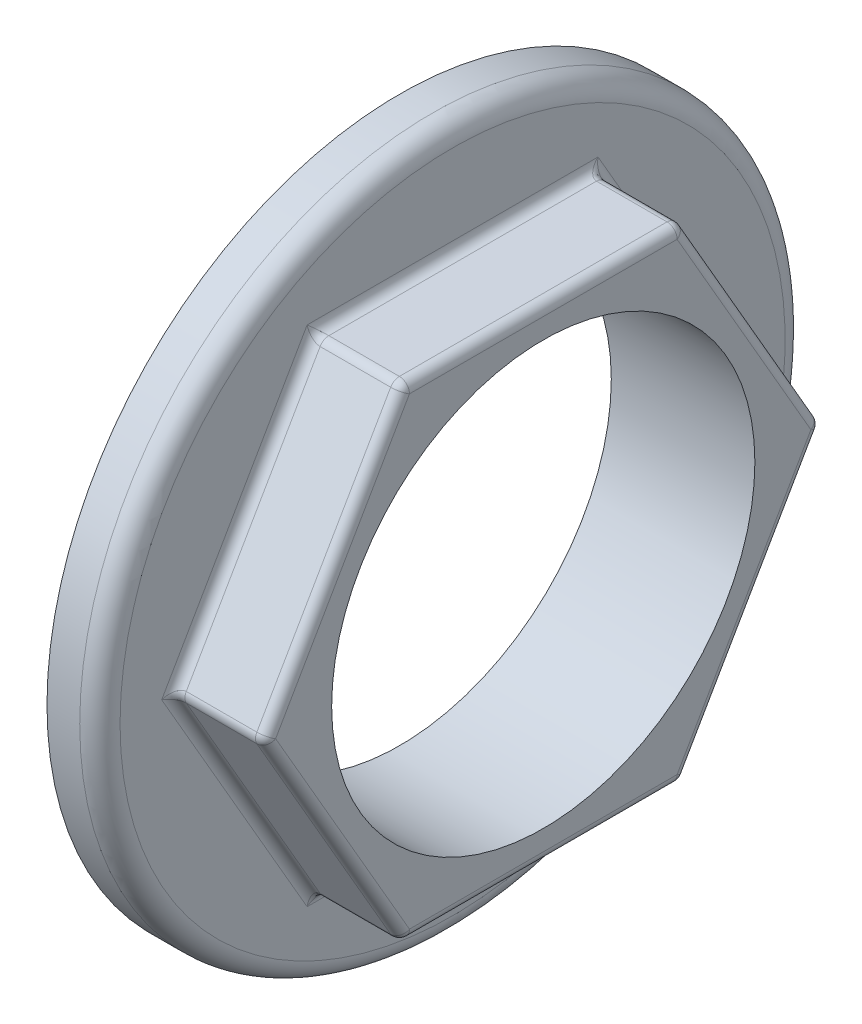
ISO-10303-21;
HEADER;
FILE_DESCRIPTION(('STEP AP214'),'2;1');
FILE_NAME('part.step','',(''),(''),'','','');
FILE_SCHEMA(('AUTOMOTIVE_DESIGN { 1 0 10303 214 1 1 1 1 }'));
ENDSEC;
DATA;
#1=APPLICATION_CONTEXT('core data for automotive mechanical design processes');
#2=APPLICATION_PROTOCOL_DEFINITION('international standard','automotive_design',2000,#1);
#3=PRODUCT_CONTEXT('',#1,'mechanical');
#4=PRODUCT('Part','Part','',(#3));
#5=PRODUCT_RELATED_PRODUCT_CATEGORY('part','',(#4));
#6=PRODUCT_DEFINITION_FORMATION('','',#4);
#7=PRODUCT_DEFINITION_CONTEXT('part definition',#1,'design');
#8=PRODUCT_DEFINITION('design','',#6,#7);
#9=PRODUCT_DEFINITION_SHAPE('','',#8);
#10=(LENGTH_UNIT() NAMED_UNIT(*) SI_UNIT(.MILLI.,.METRE.));
#11=(NAMED_UNIT(*) PLANE_ANGLE_UNIT() SI_UNIT($,.RADIAN.));
#12=(NAMED_UNIT(*) SI_UNIT($,.STERADIAN.) SOLID_ANGLE_UNIT());
#13=UNCERTAINTY_MEASURE_WITH_UNIT(LENGTH_MEASURE(1.E-05),#10,'distance_accuracy_value','');
#14=(GEOMETRIC_REPRESENTATION_CONTEXT(3) GLOBAL_UNCERTAINTY_ASSIGNED_CONTEXT((#13)) GLOBAL_UNIT_ASSIGNED_CONTEXT((#10,
#11,#12)) REPRESENTATION_CONTEXT('',''));
#15=CARTESIAN_POINT('',(0.,0.,0.));
#16=DIRECTION('',(0.,0.,1.));
#17=DIRECTION('',(1.,0.,0.));
#18=AXIS2_PLACEMENT_3D('',#15,#16,#17);
#19=CARTESIAN_POINT('',(5.25,33.,0.));
#20=DIRECTION('',(-1.,0.,0.));
#21=DIRECTION('',(0.,0.,1.));
#22=AXIS2_PLACEMENT_3D('',#19,#20,#21);
#23=PLANE('',#22);
#24=DIRECTION('',(0.,0.,1.));
#25=VECTOR('',#24,1.);
#26=CARTESIAN_POINT('',(5.25,25.,-13.856406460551));
#27=LINE('',#26,#25);
#28=CARTESIAN_POINT('',(5.25,25.,14.4337567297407));
#29=VERTEX_POINT('',#28);
#30=CARTESIAN_POINT('',(5.25,25.,-14.4337567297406));
#31=VERTEX_POINT('',#30);
#32=EDGE_CURVE('E187',#29,#31,#27,.F.);
#33=ORIENTED_EDGE('',*,*,#32,.T.);
#34=DIRECTION('',(0.,0.866025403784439,0.5));
#35=VECTOR('',#34,1.);
#36=CARTESIAN_POINT('',(5.25,0.500000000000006,-28.5788383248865));
#37=LINE('',#36,#35);
#38=CARTESIAN_POINT('',(5.25,0.,-28.8675134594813));
#39=VERTEX_POINT('',#38);
#40=EDGE_CURVE('E157',#31,#39,#37,.F.);
#41=ORIENTED_EDGE('',*,*,#40,.T.);
#42=DIRECTION('',(0.,0.866025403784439,-0.5));
#43=VECTOR('',#42,1.);
#44=CARTESIAN_POINT('',(5.25,-24.5,-14.7224318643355));
#45=LINE('',#44,#43);
#46=CARTESIAN_POINT('',(5.25,-25.,-14.4337567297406));
#47=VERTEX_POINT('',#46);
#48=EDGE_CURVE('E171',#39,#47,#45,.F.);
#49=ORIENTED_EDGE('',*,*,#48,.T.);
#50=DIRECTION('',(0.,0.,-1.));
#51=VECTOR('',#50,1.);
#52=CARTESIAN_POINT('',(5.25,-25.,13.856406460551));
#53=LINE('',#52,#51);
#54=CARTESIAN_POINT('',(5.25,-25.,14.4337567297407));
#55=VERTEX_POINT('',#54);
#56=EDGE_CURVE('E181',#47,#55,#53,.F.);
#57=ORIENTED_EDGE('',*,*,#56,.T.);
#58=DIRECTION('',(0.,-0.866025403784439,-0.5));
#59=VECTOR('',#58,1.);
#60=CARTESIAN_POINT('',(5.25,-0.500000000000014,28.5788383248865));
#61=LINE('',#60,#59);
#62=CARTESIAN_POINT('',(5.25,0.,28.8675134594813));
#63=VERTEX_POINT('',#62);
#64=EDGE_CURVE('E560',#55,#63,#61,.F.);
#65=ORIENTED_EDGE('',*,*,#64,.T.);
#66=DIRECTION('',(0.,-0.866025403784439,0.5));
#67=VECTOR('',#66,1.);
#68=CARTESIAN_POINT('',(5.25,24.5,14.7224318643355));
#69=LINE('',#68,#67);
#70=EDGE_CURVE('E565',#63,#29,#69,.F.);
#71=ORIENTED_EDGE('',*,*,#70,.T.);
#72=EDGE_LOOP('',(#33,#41,#49,#57,#65,#71));
#73=FACE_BOUND('',#72,.T.);
#74=CARTESIAN_POINT('',(5.25,0.,0.));
#75=DIRECTION('',(-1.,0.,0.));
#76=DIRECTION('',(0.,0.,1.));
#77=AXIS2_PLACEMENT_3D('',#74,#75,#76);
#78=CIRCLE('',#77,33.);
#79=CARTESIAN_POINT('',(5.25,0.,33.));
#80=VERTEX_POINT('',#79);
#81=EDGE_CURVE('E583',#80,#80,#78,.T.);
#82=ORIENTED_EDGE('',*,*,#81,.F.);
#83=EDGE_LOOP('',(#82));
#84=FACE_BOUND('',#83,.T.);
#85=ADVANCED_FACE('F31',(#73,#84),#23,.F.);
#86=CARTESIAN_POINT('',(-8.84177215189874,0.,0.));
#87=DIRECTION('',(-1.,0.,0.));
#88=DIRECTION('',(0.,0.,1.));
#89=AXIS2_PLACEMENT_3D('',#86,#87,#88);
#90=CYLINDRICAL_SURFACE('',#89,21.);
#91=CARTESIAN_POINT('',(0.,0.,0.));
#92=DIRECTION('',(-1.,0.,0.));
#93=DIRECTION('',(0.,0.,1.));
#94=AXIS2_PLACEMENT_3D('',#91,#92,#93);
#95=CIRCLE('',#94,21.);
#96=CARTESIAN_POINT('',(0.,0.,21.));
#97=VERTEX_POINT('',#96);
#98=EDGE_CURVE('E286',#97,#97,#95,.T.);
#99=ORIENTED_EDGE('',*,*,#98,.T.);
#100=EDGE_LOOP('',(#99));
#101=FACE_BOUND('',#100,.T.);
#102=CARTESIAN_POINT('',(14.25,0.,0.));
#103=DIRECTION('',(1.,0.,0.));
#104=DIRECTION('',(0.,0.,-1.));
#105=AXIS2_PLACEMENT_3D('',#102,#103,#104);
#106=CIRCLE('',#105,21.);
#107=CARTESIAN_POINT('',(14.25,0.,-21.));
#108=VERTEX_POINT('',#107);
#109=EDGE_CURVE('E282',#108,#108,#106,.T.);
#110=ORIENTED_EDGE('',*,*,#109,.T.);
#111=EDGE_LOOP('',(#110));
#112=FACE_BOUND('',#111,.T.);
#113=ADVANCED_FACE('F33',(#101,#112),#90,.F.);
#114=CARTESIAN_POINT('',(3.25,0.,0.));
#115=DIRECTION('',(-1.,0.,0.));
#116=DIRECTION('',(0.,0.,1.));
#117=AXIS2_PLACEMENT_3D('',#114,#115,#116);
#118=TOROIDAL_SURFACE('',#117,33.,2.);
#119=CARTESIAN_POINT('',(3.25,0.,0.));
#120=DIRECTION('',(-1.,0.,0.));
#121=DIRECTION('',(0.,0.,1.));
#122=AXIS2_PLACEMENT_3D('',#119,#120,#121);
#123=CIRCLE('',#122,35.);
#124=CARTESIAN_POINT('',(3.25,0.,35.));
#125=VERTEX_POINT('',#124);
#126=EDGE_CURVE('E586',#125,#125,#123,.T.);
#127=ORIENTED_EDGE('',*,*,#126,.F.);
#128=EDGE_LOOP('',(#127));
#129=FACE_BOUND('',#128,.T.);
#130=ORIENTED_EDGE('',*,*,#81,.T.);
#131=EDGE_LOOP('',(#130));
#132=FACE_BOUND('',#131,.T.);
#133=ADVANCED_FACE('F387',(#129,#132),#118,.T.);
#134=CARTESIAN_POINT('',(-8.84177215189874,0.,0.));
#135=DIRECTION('',(-1.,0.,0.));
#136=DIRECTION('',(0.,0.,1.));
#137=AXIS2_PLACEMENT_3D('',#134,#135,#136);
#138=CYLINDRICAL_SURFACE('',#137,35.);
#139=CARTESIAN_POINT('',(0.,0.,0.));
#140=DIRECTION('',(-1.,0.,0.));
#141=DIRECTION('',(0.,0.,1.));
#142=AXIS2_PLACEMENT_3D('',#139,#140,#141);
#143=CIRCLE('',#142,35.);
#144=CARTESIAN_POINT('',(0.,0.,35.));
#145=VERTEX_POINT('',#144);
#146=EDGE_CURVE('E591',#145,#145,#143,.T.);
#147=ORIENTED_EDGE('',*,*,#146,.F.);
#148=EDGE_LOOP('',(#147));
#149=FACE_BOUND('',#148,.T.);
#150=ORIENTED_EDGE('',*,*,#126,.T.);
#151=EDGE_LOOP('',(#150));
#152=FACE_BOUND('',#151,.T.);
#153=ADVANCED_FACE('F392',(#149,#152),#138,.T.);
#154=CARTESIAN_POINT('',(0.,21.,0.));
#155=DIRECTION('',(1.,0.,0.));
#156=DIRECTION('',(0.,0.,-1.));
#157=AXIS2_PLACEMENT_3D('',#154,#155,#156);
#158=PLANE('',#157);
#159=ORIENTED_EDGE('',*,*,#98,.F.);
#160=EDGE_LOOP('',(#159));
#161=FACE_BOUND('',#160,.T.);
#162=ORIENTED_EDGE('',*,*,#146,.T.);
#163=EDGE_LOOP('',(#162));
#164=FACE_BOUND('',#163,.T.);
#165=ADVANCED_FACE('F396',(#161,#164),#158,.F.);
#166=CARTESIAN_POINT('',(14.25,-24.,-13.856406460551));
#167=DIRECTION('',(-1.,0.,0.));
#168=DIRECTION('',(0.,0.,1.));
#169=AXIS2_PLACEMENT_3D('',#166,#167,#168);
#170=PLANE('',#169);
#171=DIRECTION('',(0.,-0.866025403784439,-0.5));
#172=VECTOR('',#171,1.);
#173=CARTESIAN_POINT('',(14.25,-35.5,6.06217782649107));
#174=LINE('',#173,#172);
#175=CARTESIAN_POINT('',(14.25,0.,26.5581123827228));
#176=VERTEX_POINT('',#175);
#177=CARTESIAN_POINT('',(14.25,-23.,13.2790561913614));
#178=VERTEX_POINT('',#177);
#179=EDGE_CURVE('E220',#176,#178,#174,.T.);
#180=ORIENTED_EDGE('',*,*,#179,.T.);
#181=DIRECTION('',(0.,0.,-1.));
#182=VECTOR('',#181,1.);
#183=CARTESIAN_POINT('',(14.25,-23.,-13.856406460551));
#184=LINE('',#183,#182);
#185=CARTESIAN_POINT('',(14.25,-23.,-13.2790561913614));
#186=VERTEX_POINT('',#185);
#187=EDGE_CURVE('E226',#178,#186,#184,.T.);
#188=ORIENTED_EDGE('',*,*,#187,.T.);
#189=DIRECTION('',(0.,0.866025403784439,-0.5));
#190=VECTOR('',#189,1.);
#191=CARTESIAN_POINT('',(14.25,-23.5,-12.9903810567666));
#192=LINE('',#191,#190);
#193=CARTESIAN_POINT('',(14.25,0.,-26.5581123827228));
#194=VERTEX_POINT('',#193);
#195=EDGE_CURVE('E224',#186,#194,#192,.T.);
#196=ORIENTED_EDGE('',*,*,#195,.T.);
#197=DIRECTION('',(0.,0.866025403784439,0.5));
#198=VECTOR('',#197,1.);
#199=CARTESIAN_POINT('',(14.25,-12.5,-33.7749907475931));
#200=LINE('',#199,#198);
#201=CARTESIAN_POINT('',(14.25,23.,-13.2790561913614));
#202=VERTEX_POINT('',#201);
#203=EDGE_CURVE('E222',#194,#202,#200,.T.);
#204=ORIENTED_EDGE('',*,*,#203,.T.);
#205=DIRECTION('',(0.,0.,1.));
#206=VECTOR('',#205,1.);
#207=CARTESIAN_POINT('',(14.25,23.,-13.856406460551));
#208=LINE('',#207,#206);
#209=CARTESIAN_POINT('',(14.25,23.,13.2790561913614));
#210=VERTEX_POINT('',#209);
#211=EDGE_CURVE('E218',#202,#210,#208,.T.);
#212=ORIENTED_EDGE('',*,*,#211,.T.);
#213=DIRECTION('',(0.,-0.866025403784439,0.5));
#214=VECTOR('',#213,1.);
#215=CARTESIAN_POINT('',(14.25,-0.500000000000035,26.8467875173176));
#216=LINE('',#215,#214);
#217=EDGE_CURVE('E216',#210,#176,#216,.T.);
#218=ORIENTED_EDGE('',*,*,#217,.T.);
#219=EDGE_LOOP('',(#180,#188,#196,#204,#212,#218));
#220=FACE_BOUND('',#219,.T.);
#221=ORIENTED_EDGE('',*,*,#109,.F.);
#222=EDGE_LOOP('',(#221));
#223=FACE_BOUND('',#222,.T.);
#224=ADVANCED_FACE('F330',(#220,#223),#170,.F.);
#225=CARTESIAN_POINT('',(14.25,-24.,-13.856406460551));
#226=DIRECTION('',(0.,0.5,0.866025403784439));
#227=DIRECTION('',(0.,-0.866025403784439,0.5));
#228=AXIS2_PLACEMENT_3D('',#225,#226,#227);
#229=PLANE('',#228);
#230=DIRECTION('',(0.,0.866025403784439,-0.5));
#231=VECTOR('',#230,1.);
#232=CARTESIAN_POINT('',(13.25,-24.,-13.856406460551));
#233=LINE('',#232,#231);
#234=CARTESIAN_POINT('',(13.25,-0.499999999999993,-27.4241377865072));
#235=VERTEX_POINT('',#234);
#236=CARTESIAN_POINT('',(13.25,-23.5,-14.1450815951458));
#237=VERTEX_POINT('',#236);
#238=EDGE_CURVE('E237',#235,#237,#233,.F.);
#239=ORIENTED_EDGE('',*,*,#238,.T.);
#240=DIRECTION('',(-1.,0.,0.));
#241=VECTOR('',#240,1.);
#242=CARTESIAN_POINT('',(14.25,-23.5,-14.1450815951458));
#243=LINE('',#242,#241);
#244=CARTESIAN_POINT('',(6.25,-23.5,-14.1450815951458));
#245=VERTEX_POINT('',#244);
#246=EDGE_CURVE('E239',#237,#245,#243,.T.);
#247=ORIENTED_EDGE('',*,*,#246,.T.);
#248=DIRECTION('',(0.,0.866025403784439,-0.5));
#249=VECTOR('',#248,1.);
#250=CARTESIAN_POINT('',(6.25,0.,-27.712812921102));
#251=LINE('',#250,#249);
#252=CARTESIAN_POINT('',(6.25,-0.499999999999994,-27.4241377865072));
#253=VERTEX_POINT('',#252);
#254=EDGE_CURVE('E193',#245,#253,#251,.T.);
#255=ORIENTED_EDGE('',*,*,#254,.T.);
#256=DIRECTION('',(-1.,0.,0.));
#257=VECTOR('',#256,1.);
#258=CARTESIAN_POINT('',(14.25,-0.499999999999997,-27.4241377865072));
#259=LINE('',#258,#257);
#260=EDGE_CURVE('E235',#253,#235,#259,.F.);
#261=ORIENTED_EDGE('',*,*,#260,.T.);
#262=EDGE_LOOP('',(#239,#247,#255,#261));
#263=FACE_BOUND('',#262,.T.);
#264=ADVANCED_FACE('F401',(#263),#229,.F.);
#265=CARTESIAN_POINT('',(14.25,0.,-27.712812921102));
#266=DIRECTION('',(0.,-0.5,0.866025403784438));
#267=DIRECTION('',(0.,-0.866025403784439,-0.5));
#268=AXIS2_PLACEMENT_3D('',#265,#266,#267);
#269=PLANE('',#268);
#270=DIRECTION('',(0.,0.866025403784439,0.5));
#271=VECTOR('',#270,1.);
#272=CARTESIAN_POINT('',(13.25,0.,-27.712812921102));
#273=LINE('',#272,#271);
#274=CARTESIAN_POINT('',(13.25,23.5,-14.1450815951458));
#275=VERTEX_POINT('',#274);
#276=CARTESIAN_POINT('',(13.25,0.500000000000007,-27.4241377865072));
#277=VERTEX_POINT('',#276);
#278=EDGE_CURVE('E243',#275,#277,#273,.F.);
#279=ORIENTED_EDGE('',*,*,#278,.T.);
#280=DIRECTION('',(-1.,0.,0.));
#281=VECTOR('',#280,1.);
#282=CARTESIAN_POINT('',(14.25,0.500000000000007,-27.4241377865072));
#283=LINE('',#282,#281);
#284=CARTESIAN_POINT('',(6.25,0.499999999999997,-27.4241377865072));
#285=VERTEX_POINT('',#284);
#286=EDGE_CURVE('E245',#277,#285,#283,.T.);
#287=ORIENTED_EDGE('',*,*,#286,.T.);
#288=DIRECTION('',(0.,0.866025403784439,0.5));
#289=VECTOR('',#288,1.);
#290=CARTESIAN_POINT('',(6.25,24.,-13.856406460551));
#291=LINE('',#290,#289);
#292=CARTESIAN_POINT('',(6.25,23.5,-14.1450815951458));
#293=VERTEX_POINT('',#292);
#294=EDGE_CURVE('E160',#285,#293,#291,.T.);
#295=ORIENTED_EDGE('',*,*,#294,.T.);
#296=DIRECTION('',(-1.,0.,0.));
#297=VECTOR('',#296,1.);
#298=CARTESIAN_POINT('',(14.25,23.5,-14.1450815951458));
#299=LINE('',#298,#297);
#300=EDGE_CURVE('E241',#293,#275,#299,.F.);
#301=ORIENTED_EDGE('',*,*,#300,.T.);
#302=EDGE_LOOP('',(#279,#287,#295,#301));
#303=FACE_BOUND('',#302,.T.);
#304=ADVANCED_FACE('F404',(#303),#269,.F.);
#305=CARTESIAN_POINT('',(14.25,24.,-13.856406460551));
#306=DIRECTION('',(0.,-1.,0.));
#307=DIRECTION('',(0.,0.,-1.));
#308=AXIS2_PLACEMENT_3D('',#305,#306,#307);
#309=PLANE('',#308);
#310=DIRECTION('',(0.,0.,1.));
#311=VECTOR('',#310,1.);
#312=CARTESIAN_POINT('',(13.25,24.,-13.856406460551));
#313=LINE('',#312,#311);
#314=CARTESIAN_POINT('',(13.25,24.,13.2790561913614));
#315=VERTEX_POINT('',#314);
#316=CARTESIAN_POINT('',(13.25,24.,-13.2790561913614));
#317=VERTEX_POINT('',#316);
#318=EDGE_CURVE('E255',#315,#317,#313,.F.);
#319=ORIENTED_EDGE('',*,*,#318,.T.);
#320=DIRECTION('',(-1.,0.,0.));
#321=VECTOR('',#320,1.);
#322=CARTESIAN_POINT('',(14.25,24.,-13.2790561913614));
#323=LINE('',#322,#321);
#324=CARTESIAN_POINT('',(6.25,24.,-13.2790561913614));
#325=VERTEX_POINT('',#324);
#326=EDGE_CURVE('E257',#317,#325,#323,.T.);
#327=ORIENTED_EDGE('',*,*,#326,.T.);
#328=DIRECTION('',(0.,0.,1.));
#329=VECTOR('',#328,1.);
#330=CARTESIAN_POINT('',(6.25,24.,13.856406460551));
#331=LINE('',#330,#329);
#332=CARTESIAN_POINT('',(6.25,24.,13.2790561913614));
#333=VERTEX_POINT('',#332);
#334=EDGE_CURVE('E188',#325,#333,#331,.T.);
#335=ORIENTED_EDGE('',*,*,#334,.T.);
#336=DIRECTION('',(-1.,0.,0.));
#337=VECTOR('',#336,1.);
#338=CARTESIAN_POINT('',(14.25,24.,13.2790561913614));
#339=LINE('',#338,#337);
#340=EDGE_CURVE('E253',#333,#315,#339,.F.);
#341=ORIENTED_EDGE('',*,*,#340,.T.);
#342=EDGE_LOOP('',(#319,#327,#335,#341));
#343=FACE_BOUND('',#342,.T.);
#344=ADVANCED_FACE('F408',(#343),#309,.F.);
#345=CARTESIAN_POINT('',(14.25,24.,13.856406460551));
#346=DIRECTION('',(0.,-0.5,-0.866025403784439));
#347=DIRECTION('',(0.,0.866025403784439,-0.5));
#348=AXIS2_PLACEMENT_3D('',#345,#346,#347);
#349=PLANE('',#348);
#350=DIRECTION('',(0.,-0.866025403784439,0.5));
#351=VECTOR('',#350,1.);
#352=CARTESIAN_POINT('',(6.25,0.,27.7128129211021));
#353=LINE('',#352,#351);
#354=CARTESIAN_POINT('',(6.25,23.5,14.1450815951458));
#355=VERTEX_POINT('',#354);
#356=CARTESIAN_POINT('',(6.25,0.499999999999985,27.4241377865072));
#357=VERTEX_POINT('',#356);
#358=EDGE_CURVE('E262',#355,#357,#353,.T.);
#359=ORIENTED_EDGE('',*,*,#358,.T.);
#360=DIRECTION('',(-1.,0.,0.));
#361=VECTOR('',#360,1.);
#362=CARTESIAN_POINT('',(14.25,0.499999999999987,27.4241377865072));
#363=LINE('',#362,#361);
#364=CARTESIAN_POINT('',(13.25,0.499999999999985,27.4241377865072));
#365=VERTEX_POINT('',#364);
#366=EDGE_CURVE('E11',#357,#365,#363,.F.);
#367=ORIENTED_EDGE('',*,*,#366,.T.);
#368=DIRECTION('',(0.,-0.866025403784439,0.5));
#369=VECTOR('',#368,1.);
#370=CARTESIAN_POINT('',(13.25,24.,13.856406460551));
#371=LINE('',#370,#369);
#372=CARTESIAN_POINT('',(13.25,23.5,14.1450815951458));
#373=VERTEX_POINT('',#372);
#374=EDGE_CURVE('E39',#365,#373,#371,.F.);
#375=ORIENTED_EDGE('',*,*,#374,.T.);
#376=DIRECTION('',(-1.,0.,0.));
#377=VECTOR('',#376,1.);
#378=CARTESIAN_POINT('',(14.25,23.5,14.1450815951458));
#379=LINE('',#378,#377);
#380=EDGE_CURVE('E259',#373,#355,#379,.T.);
#381=ORIENTED_EDGE('',*,*,#380,.T.);
#382=EDGE_LOOP('',(#359,#367,#375,#381));
#383=FACE_BOUND('',#382,.T.);
#384=ADVANCED_FACE('F261',(#383),#349,.F.);
#385=CARTESIAN_POINT('',(14.25,0.,27.7128129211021));
#386=DIRECTION('',(0.,0.5,-0.866025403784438));
#387=DIRECTION('',(0.,0.866025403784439,0.5));
#388=AXIS2_PLACEMENT_3D('',#385,#386,#387);
#389=PLANE('',#388);
#390=DIRECTION('',(0.,-0.866025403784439,-0.5));
#391=VECTOR('',#390,1.);
#392=CARTESIAN_POINT('',(6.25,-24.,13.856406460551));
#393=LINE('',#392,#391);
#394=CARTESIAN_POINT('',(6.25,-0.500000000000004,27.4241377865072));
#395=VERTEX_POINT('',#394);
#396=CARTESIAN_POINT('',(6.25,-23.5,14.1450815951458));
#397=VERTEX_POINT('',#396);
#398=EDGE_CURVE('E273',#395,#397,#393,.T.);
#399=ORIENTED_EDGE('',*,*,#398,.T.);
#400=DIRECTION('',(-1.,0.,0.));
#401=VECTOR('',#400,1.);
#402=CARTESIAN_POINT('',(14.25,-23.5,14.1450815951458));
#403=LINE('',#402,#401);
#404=CARTESIAN_POINT('',(13.25,-23.5,14.1450815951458));
#405=VERTEX_POINT('',#404);
#406=EDGE_CURVE('E251',#397,#405,#403,.F.);
#407=ORIENTED_EDGE('',*,*,#406,.T.);
#408=DIRECTION('',(0.,-0.866025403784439,-0.5));
#409=VECTOR('',#408,1.);
#410=CARTESIAN_POINT('',(13.25,0.,27.7128129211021));
#411=LINE('',#410,#409);
#412=CARTESIAN_POINT('',(13.25,-0.500000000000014,27.4241377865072));
#413=VERTEX_POINT('',#412);
#414=EDGE_CURVE('E249',#405,#413,#411,.F.);
#415=ORIENTED_EDGE('',*,*,#414,.T.);
#416=DIRECTION('',(-1.,0.,0.));
#417=VECTOR('',#416,1.);
#418=CARTESIAN_POINT('',(14.25,-0.500000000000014,27.4241377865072));
#419=LINE('',#418,#417);
#420=EDGE_CURVE('E247',#413,#395,#419,.T.);
#421=ORIENTED_EDGE('',*,*,#420,.T.);
#422=EDGE_LOOP('',(#399,#407,#415,#421));
#423=FACE_BOUND('',#422,.T.);
#424=ADVANCED_FACE('F415',(#423),#389,.F.);
#425=CARTESIAN_POINT('',(14.25,-24.,13.856406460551));
#426=DIRECTION('',(0.,1.,0.));
#427=DIRECTION('',(0.,0.,1.));
#428=AXIS2_PLACEMENT_3D('',#425,#426,#427);
#429=PLANE('',#428);
#430=DIRECTION('',(0.,0.,-1.));
#431=VECTOR('',#430,1.);
#432=CARTESIAN_POINT('',(6.25,-24.,-13.856406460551));
#433=LINE('',#432,#431);
#434=CARTESIAN_POINT('',(6.25,-24.,13.2790561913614));
#435=VERTEX_POINT('',#434);
#436=CARTESIAN_POINT('',(6.25,-24.,-13.2790561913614));
#437=VERTEX_POINT('',#436);
#438=EDGE_CURVE('E197',#435,#437,#433,.T.);
#439=ORIENTED_EDGE('',*,*,#438,.T.);
#440=DIRECTION('',(-1.,0.,0.));
#441=VECTOR('',#440,1.);
#442=CARTESIAN_POINT('',(14.25,-24.,-13.2790561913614));
#443=LINE('',#442,#441);
#444=CARTESIAN_POINT('',(13.25,-24.,-13.2790561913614));
#445=VERTEX_POINT('',#444);
#446=EDGE_CURVE('E233',#437,#445,#443,.F.);
#447=ORIENTED_EDGE('',*,*,#446,.T.);
#448=DIRECTION('',(0.,0.,-1.));
#449=VECTOR('',#448,1.);
#450=CARTESIAN_POINT('',(13.25,-24.,13.856406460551));
#451=LINE('',#450,#449);
#452=CARTESIAN_POINT('',(13.25,-24.,13.2790561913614));
#453=VERTEX_POINT('',#452);
#454=EDGE_CURVE('E231',#445,#453,#451,.F.);
#455=ORIENTED_EDGE('',*,*,#454,.T.);
#456=DIRECTION('',(-1.,0.,0.));
#457=VECTOR('',#456,1.);
#458=CARTESIAN_POINT('',(14.25,-24.,13.2790561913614));
#459=LINE('',#458,#457);
#460=EDGE_CURVE('E229',#453,#435,#459,.T.);
#461=ORIENTED_EDGE('',*,*,#460,.T.);
#462=EDGE_LOOP('',(#439,#447,#455,#461));
#463=FACE_BOUND('',#462,.T.);
#464=ADVANCED_FACE('F328',(#463),#429,.F.);
#465=CARTESIAN_POINT('',(6.25,-0.500000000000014,28.5788383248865));
#466=DIRECTION('',(0.,0.866025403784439,0.5));
#467=DIRECTION('',(0.,-0.5,0.866025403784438));
#468=AXIS2_PLACEMENT_3D('',#465,#466,#467);
#469=CYLINDRICAL_SURFACE('',#468,1.);
#470=ORIENTED_EDGE('',*,*,#64,.F.);
#471=CARTESIAN_POINT('',(6.25,-25.,14.4337567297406));
#472=DIRECTION('',(0.,-0.188982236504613,-0.981980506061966));
#473=DIRECTION('',(0.,-0.981980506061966,0.188982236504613));
#474=AXIS2_PLACEMENT_3D('',#471,#472,#473);
#475=ELLIPSE('',#474,1.52752523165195,1.);
#476=EDGE_CURVE('E206',#55,#397,#475,.T.);
#477=ORIENTED_EDGE('',*,*,#476,.T.);
#478=ORIENTED_EDGE('',*,*,#398,.F.);
#479=CARTESIAN_POINT('',(6.25,0.,28.8675134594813));
#480=DIRECTION('',(0.,-0.944911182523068,0.327326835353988));
#481=DIRECTION('',(0.,-0.327326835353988,-0.944911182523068));
#482=AXIS2_PLACEMENT_3D('',#479,#480,#481);
#483=ELLIPSE('',#482,1.52752523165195,1.);
#484=EDGE_CURVE('E165',#395,#63,#483,.F.);
#485=ORIENTED_EDGE('',*,*,#484,.T.);
#486=EDGE_LOOP('',(#470,#477,#478,#485));
#487=FACE_BOUND('',#486,.T.);
#488=ADVANCED_FACE('F324',(#487),#469,.F.);
#489=CARTESIAN_POINT('',(6.25,-25.,13.856406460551));
#490=DIRECTION('',(0.,0.,1.));
#491=DIRECTION('',(1.,0.,0.));
#492=AXIS2_PLACEMENT_3D('',#489,#490,#491);
#493=CYLINDRICAL_SURFACE('',#492,1.);
#494=ORIENTED_EDGE('',*,*,#56,.F.);
#495=CARTESIAN_POINT('',(6.25,-25.,-14.4337567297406));
#496=DIRECTION('',(0.,0.755928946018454,-0.654653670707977));
#497=DIRECTION('',(0.,-0.654653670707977,-0.755928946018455));
#498=AXIS2_PLACEMENT_3D('',#495,#496,#497);
#499=ELLIPSE('',#498,1.52752523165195,1.);
#500=EDGE_CURVE('E202',#47,#437,#499,.T.);
#501=ORIENTED_EDGE('',*,*,#500,.T.);
#502=ORIENTED_EDGE('',*,*,#438,.F.);
#503=CARTESIAN_POINT('',(6.25,-25.,14.4337567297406));
#504=DIRECTION('',(0.,-0.755928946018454,-0.654653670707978));
#505=DIRECTION('',(0.,-0.654653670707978,0.755928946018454));
#506=AXIS2_PLACEMENT_3D('',#503,#504,#505);
#507=ELLIPSE('',#506,1.52752523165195,1.);
#508=EDGE_CURVE('E195',#435,#55,#507,.F.);
#509=ORIENTED_EDGE('',*,*,#508,.T.);
#510=EDGE_LOOP('',(#494,#501,#502,#509));
#511=FACE_BOUND('',#510,.T.);
#512=ADVANCED_FACE('F311',(#511),#493,.F.);
#513=CARTESIAN_POINT('',(6.25,24.5,14.7224318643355));
#514=DIRECTION('',(0.,0.866025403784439,-0.5));
#515=DIRECTION('',(0.,0.5,0.866025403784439));
#516=AXIS2_PLACEMENT_3D('',#513,#514,#515);
#517=CYLINDRICAL_SURFACE('',#516,1.);
#518=ORIENTED_EDGE('',*,*,#70,.F.);
#519=CARTESIAN_POINT('',(6.25,0.,28.8675134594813));
#520=DIRECTION('',(0.,-0.944911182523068,-0.327326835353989));
#521=DIRECTION('',(0.,0.327326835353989,-0.944911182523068));
#522=AXIS2_PLACEMENT_3D('',#519,#520,#521);
#523=ELLIPSE('',#522,1.52752523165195,1.);
#524=EDGE_CURVE('E214',#63,#357,#523,.T.);
#525=ORIENTED_EDGE('',*,*,#524,.T.);
#526=ORIENTED_EDGE('',*,*,#358,.F.);
#527=CARTESIAN_POINT('',(6.25,25.,14.4337567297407));
#528=DIRECTION('',(0.,-0.188982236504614,0.981980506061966));
#529=DIRECTION('',(0.,-0.981980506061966,-0.188982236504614));
#530=AXIS2_PLACEMENT_3D('',#527,#528,#529);
#531=ELLIPSE('',#530,1.52752523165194,1.);
#532=EDGE_CURVE('E212',#355,#29,#531,.F.);
#533=ORIENTED_EDGE('',*,*,#532,.T.);
#534=EDGE_LOOP('',(#518,#525,#526,#533));
#535=FACE_BOUND('',#534,.T.);
#536=ADVANCED_FACE('F271',(#535),#517,.F.);
#537=CARTESIAN_POINT('',(6.25,-24.5,-14.7224318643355));
#538=DIRECTION('',(0.,-0.866025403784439,0.5));
#539=DIRECTION('',(0.,-0.5,-0.866025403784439));
#540=AXIS2_PLACEMENT_3D('',#537,#538,#539);
#541=CYLINDRICAL_SURFACE('',#540,1.);
#542=ORIENTED_EDGE('',*,*,#254,.F.);
#543=CARTESIAN_POINT('',(6.25,-25.,-14.4337567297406));
#544=DIRECTION('',(0.,0.188982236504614,-0.981980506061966));
#545=DIRECTION('',(0.,-0.981980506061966,-0.188982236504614));
#546=AXIS2_PLACEMENT_3D('',#543,#544,#545);
#547=ELLIPSE('',#546,1.52752523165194,1.);
#548=EDGE_CURVE('E177',#245,#47,#547,.F.);
#549=ORIENTED_EDGE('',*,*,#548,.T.);
#550=ORIENTED_EDGE('',*,*,#48,.F.);
#551=CARTESIAN_POINT('',(6.25,0.,-28.8675134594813));
#552=DIRECTION('',(0.,0.944911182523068,0.327326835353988));
#553=DIRECTION('',(0.,0.327326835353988,-0.944911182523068));
#554=AXIS2_PLACEMENT_3D('',#551,#552,#553);
#555=ELLIPSE('',#554,1.52752523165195,1.);
#556=EDGE_CURVE('E174',#39,#253,#555,.T.);
#557=ORIENTED_EDGE('',*,*,#556,.T.);
#558=EDGE_LOOP('',(#542,#549,#550,#557));
#559=FACE_BOUND('',#558,.T.);
#560=ADVANCED_FACE('F173',(#559),#541,.F.);
#561=CARTESIAN_POINT('',(6.25,25.,-13.856406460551));
#562=DIRECTION('',(0.,0.,-1.));
#563=DIRECTION('',(0.,1.,0.));
#564=AXIS2_PLACEMENT_3D('',#561,#562,#563);
#565=CYLINDRICAL_SURFACE('',#564,1.);
#566=ORIENTED_EDGE('',*,*,#334,.F.);
#567=CARTESIAN_POINT('',(6.25,25.,-14.4337567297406));
#568=DIRECTION('',(0.,0.755928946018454,0.654653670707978));
#569=DIRECTION('',(0.,-0.654653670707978,0.755928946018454));
#570=AXIS2_PLACEMENT_3D('',#567,#568,#569);
#571=ELLIPSE('',#570,1.52752523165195,1.);
#572=EDGE_CURVE('E210',#325,#31,#571,.F.);
#573=ORIENTED_EDGE('',*,*,#572,.T.);
#574=ORIENTED_EDGE('',*,*,#32,.F.);
#575=CARTESIAN_POINT('',(6.25,25.,14.4337567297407));
#576=DIRECTION('',(0.,-0.755928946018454,0.654653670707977));
#577=DIRECTION('',(0.,-0.654653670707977,-0.755928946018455));
#578=AXIS2_PLACEMENT_3D('',#575,#576,#577);
#579=ELLIPSE('',#578,1.52752523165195,1.);
#580=EDGE_CURVE('E208',#29,#333,#579,.T.);
#581=ORIENTED_EDGE('',*,*,#580,.T.);
#582=EDGE_LOOP('',(#566,#573,#574,#581));
#583=FACE_BOUND('',#582,.T.);
#584=ADVANCED_FACE('F305',(#583),#565,.F.);
#585=CARTESIAN_POINT('',(6.25,0.500000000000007,-28.5788383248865));
#586=DIRECTION('',(0.,-0.866025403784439,-0.5));
#587=DIRECTION('',(0.,0.5,-0.866025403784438));
#588=AXIS2_PLACEMENT_3D('',#585,#586,#587);
#589=CYLINDRICAL_SURFACE('',#588,1.);
#590=ORIENTED_EDGE('',*,*,#294,.F.);
#591=CARTESIAN_POINT('',(6.25,0.,-28.8675134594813));
#592=DIRECTION('',(0.,0.944911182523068,-0.327326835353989));
#593=DIRECTION('',(0.,-0.327326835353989,-0.944911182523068));
#594=AXIS2_PLACEMENT_3D('',#591,#592,#593);
#595=ELLIPSE('',#594,1.52752523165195,1.);
#596=EDGE_CURVE('E153',#285,#39,#595,.F.);
#597=ORIENTED_EDGE('',*,*,#596,.T.);
#598=ORIENTED_EDGE('',*,*,#40,.F.);
#599=CARTESIAN_POINT('',(6.25,25.,-14.4337567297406));
#600=DIRECTION('',(0.,0.188982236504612,0.981980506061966));
#601=DIRECTION('',(0.,-0.981980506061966,0.188982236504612));
#602=AXIS2_PLACEMENT_3D('',#599,#600,#601);
#603=ELLIPSE('',#602,1.52752523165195,1.);
#604=EDGE_CURVE('E166',#31,#293,#603,.T.);
#605=ORIENTED_EDGE('',*,*,#604,.T.);
#606=EDGE_LOOP('',(#590,#597,#598,#605));
#607=FACE_BOUND('',#606,.T.);
#608=ADVANCED_FACE('F155',(#607),#589,.F.);
#609=CARTESIAN_POINT('',(7.25,25.,14.4337567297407));
#610=CARTESIAN_POINT('',(7.25,25.,14.4337567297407));
#611=CARTESIAN_POINT('',(7.25,25.,14.4337567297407));
#612=CARTESIAN_POINT('',(7.25000064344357,24.9564016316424,14.3834136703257));
#613=CARTESIAN_POINT('',(7.25009064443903,24.9454767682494,14.4022777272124));
#614=CARTESIAN_POINT('',(7.25000064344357,24.9346024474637,14.4211709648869));
#615=CARTESIAN_POINT('',(7.24714847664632,24.9127965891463,14.3330629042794));
#616=CARTESIAN_POINT('',(7.24572223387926,24.89091251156,14.3707750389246));
#617=CARTESIAN_POINT('',(7.24714847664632,24.8691948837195,14.4085832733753));
#618=CARTESIAN_POINT('',(7.2357654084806,24.8263345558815,14.2332251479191));
#619=CARTESIAN_POINT('',(7.22869766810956,24.7836848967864,14.3088671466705));
#620=CARTESIAN_POINT('',(7.2357654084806,24.7395018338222,14.3836238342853));
#621=CARTESIAN_POINT('',(7.22725861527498,24.7834751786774,14.183735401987));
#622=CARTESIAN_POINT('',(7.21602945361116,24.7308695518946,14.2783741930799));
#623=CARTESIAN_POINT('',(7.22725861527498,24.6752127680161,14.3712513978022));
#624=CARTESIAN_POINT('',(7.20468676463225,24.6992365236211,14.086464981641));
#625=CARTESIAN_POINT('',(7.18296446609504,24.6288361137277,14.2194651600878));
#626=CARTESIAN_POINT('',(7.20468676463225,24.5488547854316,14.3469337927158));
#627=CARTESIAN_POINT('',(7.19066825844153,24.6578479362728,14.0386735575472));
#628=CARTESIAN_POINT('',(7.1625453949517,24.5794735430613,14.1909656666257));
#629=CARTESIAN_POINT('',(7.19066825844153,24.4867719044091,14.3349859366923));
#630=CARTESIAN_POINT('',(7.15729082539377,24.5772680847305,13.9456279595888));
#631=CARTESIAN_POINT('',(7.11508778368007,24.4858190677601,14.1368942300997));
#632=CARTESIAN_POINT('',(7.15729082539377,24.3659021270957,14.3117245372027));
#633=CARTESIAN_POINT('',(7.13799751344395,24.5380565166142,13.9003503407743));
#634=CARTESIAN_POINT('',(7.08802006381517,24.4413975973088,14.1112474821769));
#635=CARTESIAN_POINT('',(7.13799751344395,24.3070847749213,14.3004051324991));
#636=CARTESIAN_POINT('',(7.094382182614,24.4625131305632,13.8131203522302));
#637=CARTESIAN_POINT('',(7.0287092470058,24.3588092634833,14.0635650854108));
#638=CARTESIAN_POINT('',(7.094382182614,24.1937696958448,14.278597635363));
#639=CARTESIAN_POINT('',(7.07013975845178,24.4261469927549,13.7711283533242));
#640=CARTESIAN_POINT('',(6.99643536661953,24.3205324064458,14.0414659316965));
#641=CARTESIAN_POINT('',(7.07013975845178,24.1392204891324,14.2680996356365));
#642=CARTESIAN_POINT('',(7.01702834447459,24.3569314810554,13.6912051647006));
#643=CARTESIAN_POINT('',(6.92845244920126,24.2510033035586,14.0013232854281));
#644=CARTESIAN_POINT('',(7.01702834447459,24.0353972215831,14.2481188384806));
#645=CARTESIAN_POINT('',(6.98824624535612,24.3240323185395,13.6532164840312));
#646=CARTESIAN_POINT('',(6.89271797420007,24.2196645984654,13.9832298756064));
#647=CARTESIAN_POINT('',(6.98824624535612,23.9860484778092,14.2386216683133));
#648=CARTESIAN_POINT('',(6.92654264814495,24.262329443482,13.5819681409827));
#649=CARTESIAN_POINT('',(6.81969086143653,24.1642626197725,13.9512435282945));
#650=CARTESIAN_POINT('',(6.92654264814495,23.893494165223,14.2208095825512));
#651=CARTESIAN_POINT('',(6.89370745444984,24.2334612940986,13.5486340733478));
#652=CARTESIAN_POINT('',(6.78238609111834,24.1401381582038,13.9373152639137));
#653=CARTESIAN_POINT('',(6.89370745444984,23.8501919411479,14.2124760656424));
#654=CARTESIAN_POINT('',(6.82446278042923,24.1803287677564,13.487281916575));
#655=CARTESIAN_POINT('',(6.70801211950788,24.0988274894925,13.9134645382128));
#656=CARTESIAN_POINT('',(6.82446278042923,23.7704931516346,14.1971380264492));
#657=CARTESIAN_POINT('',(6.78813078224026,24.1559890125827,13.4591767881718));
#658=CARTESIAN_POINT('',(6.67095177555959,24.0816043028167,13.9035207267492));
#659=CARTESIAN_POINT('',(6.78813078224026,23.733983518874,14.1901117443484));
#660=CARTESIAN_POINT('',(6.71252623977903,24.1123395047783,13.4087746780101));
#661=CARTESIAN_POINT('',(6.59848734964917,24.0531919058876,13.8871168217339));
#662=CARTESIAN_POINT('',(6.71252623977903,23.6685092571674,14.177511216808));
#663=CARTESIAN_POINT('',(6.67331515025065,24.0929503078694,13.3863859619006));
#664=CARTESIAN_POINT('',(6.56311870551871,24.0419858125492,13.8806469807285));
#665=CARTESIAN_POINT('',(6.67331515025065,23.639425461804,14.1719140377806));
#666=CARTESIAN_POINT('',(6.59264277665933,24.0595354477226,13.3478018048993));
#667=CARTESIAN_POINT('',(6.49478846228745,24.0242967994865,13.870434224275));
#668=CARTESIAN_POINT('',(6.59264277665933,23.5893031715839,14.1622679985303));
#669=CARTESIAN_POINT('',(6.55122252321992,24.0454358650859,13.3315210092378));
#670=CARTESIAN_POINT('',(6.46189057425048,24.0178106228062,13.8666894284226));
#671=CARTESIAN_POINT('',(6.55122252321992,23.5681537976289,14.1581977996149));
#672=CARTESIAN_POINT('',(6.46686381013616,24.0228325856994,13.3054209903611));
#673=CARTESIAN_POINT('',(6.39838749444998,24.0081603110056,13.8611178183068));
#674=CARTESIAN_POINT('',(6.46686381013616,23.5342488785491,14.1516727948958));
#675=CARTESIAN_POINT('',(6.42394602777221,24.0142713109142,13.2955352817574));
#676=CARTESIAN_POINT('',(6.36787105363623,24.0049992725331,13.8592927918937));
#677=CARTESIAN_POINT('',(6.4239460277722,23.5214069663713,14.1492013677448));
#678=CARTESIAN_POINT('',(6.33734844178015,24.0028708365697,13.282371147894));
#679=CARTESIAN_POINT('',(6.30818446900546,24.0009174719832,13.8569361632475));
#680=CARTESIAN_POINT('',(6.33734844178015,23.5043062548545,14.145910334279));
#681=CARTESIAN_POINT('',(6.29367422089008,24.,13.2790561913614));
#682=CARTESIAN_POINT('',(6.27912023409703,24.,13.856406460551));
#683=CARTESIAN_POINT('',(6.29367422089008,23.5,14.1450815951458));
#684=CARTESIAN_POINT('',(6.20632577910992,24.,13.2790561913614));
#685=CARTESIAN_POINT('',(6.22087976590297,24.,13.856406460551));
#686=CARTESIAN_POINT('',(6.20632577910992,23.5,14.1450815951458));
#687=CARTESIAN_POINT('',(6.16265155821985,24.0028708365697,13.282371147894));
#688=CARTESIAN_POINT('',(6.19181553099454,24.0009174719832,13.8569361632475));
#689=CARTESIAN_POINT('',(6.16265155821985,23.5043062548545,14.145910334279));
#690=CARTESIAN_POINT('',(6.0760539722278,24.0142713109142,13.2955352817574));
#691=CARTESIAN_POINT('',(6.13212894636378,24.0049992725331,13.8592927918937));
#692=CARTESIAN_POINT('',(6.0760539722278,23.5214069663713,14.1492013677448));
#693=CARTESIAN_POINT('',(6.03313618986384,24.0228325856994,13.3054209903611));
#694=CARTESIAN_POINT('',(6.10161250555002,24.0081603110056,13.8611178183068));
#695=CARTESIAN_POINT('',(6.03313618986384,23.5342488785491,14.1516727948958));
#696=CARTESIAN_POINT('',(5.94877747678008,24.0454358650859,13.3315210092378));
#697=CARTESIAN_POINT('',(6.03810942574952,24.0178106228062,13.8666894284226));
#698=CARTESIAN_POINT('',(5.94877747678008,23.5681537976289,14.1581977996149));
#699=CARTESIAN_POINT('',(5.90735722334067,24.0595354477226,13.3478018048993));
#700=CARTESIAN_POINT('',(6.00521153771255,24.0242967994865,13.870434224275));
#701=CARTESIAN_POINT('',(5.90735722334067,23.5893031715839,14.1622679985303));
#702=CARTESIAN_POINT('',(5.82668484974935,24.0929503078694,13.3863859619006));
#703=CARTESIAN_POINT('',(5.93688129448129,24.0419858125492,13.8806469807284));
#704=CARTESIAN_POINT('',(5.82668484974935,23.639425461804,14.1719140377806));
#705=CARTESIAN_POINT('',(5.78747376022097,24.1123395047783,13.4087746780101));
#706=CARTESIAN_POINT('',(5.90151265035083,24.0531919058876,13.8871168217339));
#707=CARTESIAN_POINT('',(5.78747376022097,23.6685092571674,14.177511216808));
#708=CARTESIAN_POINT('',(5.71186921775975,24.1559890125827,13.4591767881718));
#709=CARTESIAN_POINT('',(5.82904822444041,24.0816043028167,13.9035207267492));
#710=CARTESIAN_POINT('',(5.71186921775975,23.733983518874,14.1901117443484));
#711=CARTESIAN_POINT('',(5.67553721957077,24.1803287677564,13.487281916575));
#712=CARTESIAN_POINT('',(5.79198788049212,24.0988274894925,13.9134645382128));
#713=CARTESIAN_POINT('',(5.67553721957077,23.7704931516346,14.1971380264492));
#714=CARTESIAN_POINT('',(5.60629254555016,24.2334612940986,13.5486340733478));
#715=CARTESIAN_POINT('',(5.71761390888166,24.1401381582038,13.9373152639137));
#716=CARTESIAN_POINT('',(5.60629254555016,23.8501919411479,14.2124760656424));
#717=CARTESIAN_POINT('',(5.57345735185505,24.262329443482,13.5819681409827));
#718=CARTESIAN_POINT('',(5.68030913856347,24.1642626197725,13.9512435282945));
#719=CARTESIAN_POINT('',(5.57345735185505,23.893494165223,14.2208095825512));
#720=CARTESIAN_POINT('',(5.51175375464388,24.3240323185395,13.6532164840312));
#721=CARTESIAN_POINT('',(5.60728202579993,24.2196645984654,13.9832298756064));
#722=CARTESIAN_POINT('',(5.51175375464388,23.9860484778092,14.2386216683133));
#723=CARTESIAN_POINT('',(5.48297165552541,24.3569314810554,13.6912051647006));
#724=CARTESIAN_POINT('',(5.57154755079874,24.2510033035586,14.0013232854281));
#725=CARTESIAN_POINT('',(5.48297165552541,24.0353972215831,14.2481188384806));
#726=CARTESIAN_POINT('',(5.42986024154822,24.4261469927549,13.7711283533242));
#727=CARTESIAN_POINT('',(5.50356463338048,24.3205324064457,14.0414659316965));
#728=CARTESIAN_POINT('',(5.42986024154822,24.1392204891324,14.2680996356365));
#729=CARTESIAN_POINT('',(5.405617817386,24.4625131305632,13.8131203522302));
#730=CARTESIAN_POINT('',(5.4712907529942,24.3588092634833,14.0635650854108));
#731=CARTESIAN_POINT('',(5.405617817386,24.1937696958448,14.278597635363));
#732=CARTESIAN_POINT('',(5.36200248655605,24.5380565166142,13.9003503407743));
#733=CARTESIAN_POINT('',(5.41197993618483,24.4413975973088,14.1112474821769));
#734=CARTESIAN_POINT('',(5.36200248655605,24.3070847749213,14.3004051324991));
#735=CARTESIAN_POINT('',(5.34270917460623,24.5772680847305,13.9456279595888));
#736=CARTESIAN_POINT('',(5.38491221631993,24.4858190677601,14.1368942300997));
#737=CARTESIAN_POINT('',(5.34270917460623,24.3659021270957,14.3117245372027));
#738=CARTESIAN_POINT('',(5.30933174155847,24.6578479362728,14.0386735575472));
#739=CARTESIAN_POINT('',(5.3374546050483,24.5794735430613,14.1909656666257));
#740=CARTESIAN_POINT('',(5.30933174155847,24.4867719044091,14.3349859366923));
#741=CARTESIAN_POINT('',(5.29531323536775,24.699236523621,14.086464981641));
#742=CARTESIAN_POINT('',(5.31703553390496,24.6288361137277,14.2194651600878));
#743=CARTESIAN_POINT('',(5.29531323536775,24.5488547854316,14.3469337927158));
#744=CARTESIAN_POINT('',(5.27274138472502,24.7834751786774,14.183735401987));
#745=CARTESIAN_POINT('',(5.28397054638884,24.7308695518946,14.2783741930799));
#746=CARTESIAN_POINT('',(5.27274138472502,24.6752127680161,14.3712513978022));
#747=CARTESIAN_POINT('',(5.2642345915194,24.8263345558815,14.2332251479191));
#748=CARTESIAN_POINT('',(5.27130233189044,24.7836848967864,14.3088671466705));
#749=CARTESIAN_POINT('',(5.2642345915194,24.7395018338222,14.3836238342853));
#750=CARTESIAN_POINT('',(5.25285152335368,24.9127965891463,14.3330629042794));
#751=CARTESIAN_POINT('',(5.25427776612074,24.89091251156,14.3707750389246));
#752=CARTESIAN_POINT('',(5.25285152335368,24.8691948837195,14.4085832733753));
#753=CARTESIAN_POINT('',(5.24999935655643,24.9564016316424,14.3834136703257));
#754=CARTESIAN_POINT('',(5.24990935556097,24.9454767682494,14.4022777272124));
#755=CARTESIAN_POINT('',(5.24999935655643,24.9346024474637,14.4211709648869));
#756=CARTESIAN_POINT('',(5.25,25.,14.4337567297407));
#757=CARTESIAN_POINT('',(5.25,25.,14.4337567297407));
#758=CARTESIAN_POINT('',(5.25,25.,14.4337567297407));
#759=(BOUNDED_SURFACE() B_SPLINE_SURFACE(3,2,((#609,#610,#611),(#612,#613,#614),(#615,#616,
#617),(#618,#619,#620),(#621,#622,#623),(#624,#625,#626),(#627,#628,#629),(#630,#631,#632),
(#633,#634,#635),(#636,#637,#638),(#639,#640,#641),(#642,#643,#644),(#645,#646,#647),(#648,#649,
#650),(#651,#652,#653),(#654,#655,#656),(#657,#658,#659),(#660,#661,#662),(#663,#664,#665),
(#666,#667,#668),(#669,#670,#671),(#672,#673,#674),(#675,#676,#677),(#678,#679,#680),(#681,#682,
#683),(#684,#685,#686),(#687,#688,#689),(#690,#691,#692),(#693,#694,#695),(#696,#697,#698),
(#699,#700,#701),(#702,#703,#704),(#705,#706,#707),(#708,#709,#710),(#711,#712,#713),(#714,#715,
#716),(#717,#718,#719),(#720,#721,#722),(#723,#724,#725),(#726,#727,#728),(#729,#730,#731),
(#732,#733,#734),(#735,#736,#737),(#738,#739,#740),(#741,#742,#743),(#744,#745,#746),(#747,#748,
#749),(#750,#751,#752),(#753,#754,#755),(#756,#757,#758)),.UNSPECIFIED.,.F.,.F.,
.F.) B_SPLINE_SURFACE_WITH_KNOTS((4,2,2,2,2,2,2,2,2,2,2,2,2,2,2,2,2,2,2,2,2,2,2,2,4),(3,3),(0.,
0.301922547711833,0.602566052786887,0.90072309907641,1.19532793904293,1.48552300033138,
1.77071916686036,2.05064606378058,2.32538730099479,2.5953945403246,2.86147403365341,
3.12474082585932,3.38653978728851,3.6483387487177,3.91160554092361,4.17768503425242,
4.44769227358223,4.72243351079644,5.00236040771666,5.28755657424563,5.57775163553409,
5.87235647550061,6.17051352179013,6.47115702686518,6.77307957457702),(0.,1.),
.UNSPECIFIED.) GEOMETRIC_REPRESENTATION_ITEM() RATIONAL_B_SPLINE_SURFACE(((1.,1.,1.),(1.,
1.00001029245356,1.),(1.,0.999287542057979,1.),(1.,0.99645465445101,1.),(1.,0.994350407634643,
1.),(1.,0.988854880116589,1.),(1.,0.985474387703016,1.),(1.,0.977619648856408,1.),(1.,
0.973158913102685,1.),(1.,0.963406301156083,1.),(1.,0.958127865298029,1.),(1.,0.947069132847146,
1.),(1.,0.941299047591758,1.),(1.,0.929638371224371,1.),(1.,0.923751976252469,1.),(1.,
0.912272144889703,1.),(1.,0.90667530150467,1.),(1.,0.896191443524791,1.),(1.,0.891293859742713,
1.),(1.,0.882592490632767,1.),(1.,0.878773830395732,1.),(1.,0.87254090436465,1.),(1.,
0.870112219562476,1.),(1.,0.866858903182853,1.),(1.,0.866025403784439,1.),(1.,0.866025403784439,
1.),(1.,0.866858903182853,1.),(1.,0.870112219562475,1.),(1.,0.872540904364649,1.),(1.,
0.878773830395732,1.),(1.,0.882592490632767,1.),(1.,0.891293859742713,1.),(1.,0.896191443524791,
1.),(1.,0.90667530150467,1.),(1.,0.912272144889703,1.),(1.,0.923751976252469,1.),(1.,
0.929638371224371,1.),(1.,0.941299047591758,1.),(1.,0.947069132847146,1.),(1.,0.958127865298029,
1.),(1.,0.963406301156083,1.),(1.,0.973158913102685,1.),(1.,0.977619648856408,1.),(1.,
0.985474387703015,1.),(1.,0.988854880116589,1.),(1.,0.994350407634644,1.),(1.,0.99645465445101,
1.),(1.,0.999287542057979,1.),(1.,1.00001029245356,1.),(1.,1.,1.))) REPRESENTATION_ITEM('') SURFACE());
#760=ORIENTED_EDGE('',*,*,#580,.F.);
#761=ORIENTED_EDGE('',*,*,#532,.F.);
#762=CARTESIAN_POINT('',(6.25,23.,13.2790561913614));
#763=DIRECTION('',(1.,0.,0.));
#764=DIRECTION('',(0.,0.,-1.));
#765=AXIS2_PLACEMENT_3D('',#762,#763,#764);
#766=CIRCLE('',#765,1.);
#767=EDGE_CURVE('E279',#333,#355,#766,.T.);
#768=ORIENTED_EDGE('',*,*,#767,.F.);
#769=EDGE_LOOP('',(#760,#761,#768));
#770=FACE_BOUND('',#769,.T.);
#771=ADVANCED_FACE('F278',(#770),#759,.T.);
#772=CARTESIAN_POINT('',(14.25,23.,13.2790561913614));
#773=DIRECTION('',(-1.,0.,0.));
#774=DIRECTION('',(0.,0.,1.));
#775=AXIS2_PLACEMENT_3D('',#772,#773,#774);
#776=CYLINDRICAL_SURFACE('',#775,1.);
#777=ORIENTED_EDGE('',*,*,#767,.T.);
#778=ORIENTED_EDGE('',*,*,#380,.F.);
#779=CARTESIAN_POINT('',(13.25,23.,13.2790561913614));
#780=DIRECTION('',(1.,0.,0.));
#781=DIRECTION('',(0.,0.,-1.));
#782=AXIS2_PLACEMENT_3D('',#779,#780,#781);
#783=CIRCLE('',#782,1.);
#784=EDGE_CURVE('E283',#315,#373,#783,.T.);
#785=ORIENTED_EDGE('',*,*,#784,.F.);
#786=ORIENTED_EDGE('',*,*,#340,.F.);
#787=EDGE_LOOP('',(#777,#778,#785,#786));
#788=FACE_BOUND('',#787,.T.);
#789=ADVANCED_FACE('F281',(#788),#776,.T.);
#790=CARTESIAN_POINT('',(7.25,0.,28.8675134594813));
#791=CARTESIAN_POINT('',(7.25,0.,28.8675134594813));
#792=CARTESIAN_POINT('',(7.25,0.,28.8675134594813));
#793=CARTESIAN_POINT('',(7.25000064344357,0.0217991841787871,28.8045846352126));
#794=CARTESIAN_POINT('',(7.25009064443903,0.,28.8045554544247));
#795=CARTESIAN_POINT('',(7.25000064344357,-0.0217991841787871,28.8045846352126));
#796=CARTESIAN_POINT('',(7.24714847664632,0.0436017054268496,28.7416461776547));
#797=CARTESIAN_POINT('',(7.24572223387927,0.,28.7415500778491));
#798=CARTESIAN_POINT('',(7.24714847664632,-0.0436017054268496,28.7416461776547));
#799=CARTESIAN_POINT('',(7.2357654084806,0.0868327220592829,28.6168489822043));
#800=CARTESIAN_POINT('',(7.22869766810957,0.,28.617734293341));
#801=CARTESIAN_POINT('',(7.2357654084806,-0.0868327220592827,28.6168489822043));
#802=CARTESIAN_POINT('',(7.22725861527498,0.1082624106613,28.5549867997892));
#803=CARTESIAN_POINT('',(7.21602945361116,0.,28.5567483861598));
#804=CARTESIAN_POINT('',(7.22725861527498,-0.1082624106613,28.5549867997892));
#805=CARTESIAN_POINT('',(7.20468676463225,0.150381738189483,28.4333987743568));
#806=CARTESIAN_POINT('',(7.18296446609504,0.,28.4389303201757));
#807=CARTESIAN_POINT('',(7.20468676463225,-0.150381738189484,28.4333987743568));
#808=CARTESIAN_POINT('',(7.19066825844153,0.171076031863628,28.3736594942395));
#809=CARTESIAN_POINT('',(7.1625453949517,0.,28.3819313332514));
#810=CARTESIAN_POINT('',(7.19066825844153,-0.171076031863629,28.3736594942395));
#811=CARTESIAN_POINT('',(7.15729082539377,0.21136595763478,28.2573524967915));
#812=CARTESIAN_POINT('',(7.11508778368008,0.,28.2737884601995));
#813=CARTESIAN_POINT('',(7.15729082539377,-0.211365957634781,28.2573524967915));
#814=CARTESIAN_POINT('',(7.13799751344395,0.230971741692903,28.2007554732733));
#815=CARTESIAN_POINT('',(7.08802006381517,0.,28.2224949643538));
#816=CARTESIAN_POINT('',(7.13799751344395,-0.230971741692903,28.2007554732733));
#817=CARTESIAN_POINT('',(7.094382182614,0.268743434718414,28.0917179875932));
#818=CARTESIAN_POINT('',(7.0287092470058,0.,28.1271301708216));
#819=CARTESIAN_POINT('',(7.094382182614,-0.268743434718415,28.0917179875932));
#820=CARTESIAN_POINT('',(7.07013975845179,0.286926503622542,28.0392279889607));
#821=CARTESIAN_POINT('',(6.99643536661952,0.,28.0829318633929));
#822=CARTESIAN_POINT('',(7.07013975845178,-0.286926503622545,28.0392279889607));
#823=CARTESIAN_POINT('',(7.01702834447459,0.32153425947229,27.9393240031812));
#824=CARTESIAN_POINT('',(6.92845244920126,0.,28.0026465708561));
#825=CARTESIAN_POINT('',(7.01702834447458,-0.321534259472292,27.9393240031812));
#826=CARTESIAN_POINT('',(6.98824624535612,0.337983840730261,27.8918381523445));
#827=CARTESIAN_POINT('',(6.89271797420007,0.,27.9664597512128));
#828=CARTESIAN_POINT('',(6.98824624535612,-0.337983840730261,27.8918381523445));
#829=CARTESIAN_POINT('',(6.92654264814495,0.368835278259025,27.8027777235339));
#830=CARTESIAN_POINT('',(6.81969086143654,0.,27.9024870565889));
#831=CARTESIAN_POINT('',(6.92654264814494,-0.368835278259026,27.8027777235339));
#832=CARTESIAN_POINT('',(6.89370745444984,0.383269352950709,27.7611101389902));
#833=CARTESIAN_POINT('',(6.78238609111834,0.,27.8746305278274));
#834=CARTESIAN_POINT('',(6.89370745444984,-0.383269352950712,27.7611101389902));
#835=CARTESIAN_POINT('',(6.82446278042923,0.409835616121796,27.6844199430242));
#836=CARTESIAN_POINT('',(6.70801211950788,0.,27.8269290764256));
#837=CARTESIAN_POINT('',(6.82446278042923,-0.4098356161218,27.6844199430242));
#838=CARTESIAN_POINT('',(6.78813078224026,0.422005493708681,27.6492885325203));
#839=CARTESIAN_POINT('',(6.6709517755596,0.,27.8070414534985));
#840=CARTESIAN_POINT('',(6.78813078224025,-0.422005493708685,27.6492885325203));
#841=CARTESIAN_POINT('',(6.71252623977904,0.443830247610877,27.5862858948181));
#842=CARTESIAN_POINT('',(6.59848734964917,0.,27.7742336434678));
#843=CARTESIAN_POINT('',(6.71252623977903,-0.44383024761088,27.5862858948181));
#844=CARTESIAN_POINT('',(6.67331515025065,0.453524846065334,27.5582999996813));
#845=CARTESIAN_POINT('',(6.56311870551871,0.,27.7612939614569));
#846=CARTESIAN_POINT('',(6.67331515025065,-0.453524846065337,27.5582999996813));
#847=CARTESIAN_POINT('',(6.59264277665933,0.470232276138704,27.5100698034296));
#848=CARTESIAN_POINT('',(6.49478846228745,0.,27.74086844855));
#849=CARTESIAN_POINT('',(6.59264277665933,-0.470232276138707,27.5100698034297));
#850=CARTESIAN_POINT('',(6.55122252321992,0.477282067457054,27.4897188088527));
#851=CARTESIAN_POINT('',(6.46189057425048,0.,27.7333788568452));
#852=CARTESIAN_POINT('',(6.55122252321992,-0.477282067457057,27.4897188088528));
#853=CARTESIAN_POINT('',(6.46686381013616,0.488583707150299,27.4570937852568));
#854=CARTESIAN_POINT('',(6.39838749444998,0.,27.7222356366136));
#855=CARTESIAN_POINT('',(6.46686381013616,-0.488583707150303,27.4570937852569));
#856=CARTESIAN_POINT('',(6.42394602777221,0.492864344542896,27.4447366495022));
#857=CARTESIAN_POINT('',(6.36787105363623,0.,27.7185855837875));
#858=CARTESIAN_POINT('',(6.4239460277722,-0.492864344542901,27.4447366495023));
#859=CARTESIAN_POINT('',(6.33734844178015,0.498564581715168,27.428281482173));
#860=CARTESIAN_POINT('',(6.30818446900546,0.,27.713872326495));
#861=CARTESIAN_POINT('',(6.33734844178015,-0.498564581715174,27.428281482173));
#862=CARTESIAN_POINT('',(6.29367422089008,0.499999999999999,27.4241377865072));
#863=CARTESIAN_POINT('',(6.27912023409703,0.,27.712812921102));
#864=CARTESIAN_POINT('',(6.29367422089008,-0.500000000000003,27.4241377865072));
#865=CARTESIAN_POINT('',(6.20632577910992,0.499999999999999,27.4241377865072));
#866=CARTESIAN_POINT('',(6.22087976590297,0.,27.712812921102));
#867=CARTESIAN_POINT('',(6.20632577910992,-0.500000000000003,27.4241377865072));
#868=CARTESIAN_POINT('',(6.16265155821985,0.498564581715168,27.428281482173));
#869=CARTESIAN_POINT('',(6.19181553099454,0.,27.713872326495));
#870=CARTESIAN_POINT('',(6.16265155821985,-0.498564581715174,27.428281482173));
#871=CARTESIAN_POINT('',(6.0760539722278,0.492864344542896,27.4447366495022));
#872=CARTESIAN_POINT('',(6.13212894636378,0.,27.7185855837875));
#873=CARTESIAN_POINT('',(6.0760539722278,-0.492864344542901,27.4447366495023));
#874=CARTESIAN_POINT('',(6.03313618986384,0.4885837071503,27.4570937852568));
#875=CARTESIAN_POINT('',(6.10161250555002,0.,27.7222356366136));
#876=CARTESIAN_POINT('',(6.03313618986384,-0.488583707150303,27.4570937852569));
#877=CARTESIAN_POINT('',(5.94877747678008,0.477282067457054,27.4897188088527));
#878=CARTESIAN_POINT('',(6.03810942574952,0.,27.7333788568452));
#879=CARTESIAN_POINT('',(5.94877747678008,-0.477282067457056,27.4897188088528));
#880=CARTESIAN_POINT('',(5.90735722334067,0.470232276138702,27.5100698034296));
#881=CARTESIAN_POINT('',(6.00521153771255,0.,27.74086844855));
#882=CARTESIAN_POINT('',(5.90735722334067,-0.470232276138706,27.5100698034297));
#883=CARTESIAN_POINT('',(5.82668484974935,0.453524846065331,27.5582999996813));
#884=CARTESIAN_POINT('',(5.93688129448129,0.,27.7612939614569));
#885=CARTESIAN_POINT('',(5.82668484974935,-0.453524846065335,27.5582999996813));
#886=CARTESIAN_POINT('',(5.78747376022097,0.443830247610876,27.5862858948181));
#887=CARTESIAN_POINT('',(5.90151265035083,0.,27.7742336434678));
#888=CARTESIAN_POINT('',(5.78747376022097,-0.44383024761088,27.5862858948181));
#889=CARTESIAN_POINT('',(5.71186921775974,0.422005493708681,27.6492885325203));
#890=CARTESIAN_POINT('',(5.82904822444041,0.,27.8070414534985));
#891=CARTESIAN_POINT('',(5.71186921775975,-0.422005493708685,27.6492885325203));
#892=CARTESIAN_POINT('',(5.67553721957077,0.409835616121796,27.6844199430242));
#893=CARTESIAN_POINT('',(5.79198788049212,0.,27.8269290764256));
#894=CARTESIAN_POINT('',(5.67553721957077,-0.4098356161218,27.6844199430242));
#895=CARTESIAN_POINT('',(5.60629254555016,0.383269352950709,27.7611101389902));
#896=CARTESIAN_POINT('',(5.71761390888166,0.,27.8746305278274));
#897=CARTESIAN_POINT('',(5.60629254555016,-0.383269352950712,27.7611101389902));
#898=CARTESIAN_POINT('',(5.57345735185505,0.368835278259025,27.8027777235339));
#899=CARTESIAN_POINT('',(5.68030913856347,0.,27.9024870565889));
#900=CARTESIAN_POINT('',(5.57345735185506,-0.368835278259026,27.8027777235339));
#901=CARTESIAN_POINT('',(5.51175375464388,0.337983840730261,27.8918381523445));
#902=CARTESIAN_POINT('',(5.60728202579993,0.,27.9664597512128));
#903=CARTESIAN_POINT('',(5.51175375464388,-0.337983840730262,27.8918381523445));
#904=CARTESIAN_POINT('',(5.48297165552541,0.321534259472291,27.9393240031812));
#905=CARTESIAN_POINT('',(5.57154755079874,0.,28.0026465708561));
#906=CARTESIAN_POINT('',(5.48297165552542,-0.321534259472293,27.9393240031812));
#907=CARTESIAN_POINT('',(5.42986024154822,0.286926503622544,28.0392279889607));
#908=CARTESIAN_POINT('',(5.50356463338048,0.,28.0829318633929));
#909=CARTESIAN_POINT('',(5.42986024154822,-0.286926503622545,28.0392279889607));
#910=CARTESIAN_POINT('',(5.405617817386,0.268743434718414,28.0917179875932));
#911=CARTESIAN_POINT('',(5.4712907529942,0.,28.1271301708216));
#912=CARTESIAN_POINT('',(5.40561781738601,-0.268743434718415,28.0917179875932));
#913=CARTESIAN_POINT('',(5.36200248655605,0.230971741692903,28.2007554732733));
#914=CARTESIAN_POINT('',(5.41197993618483,0.,28.2224949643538));
#915=CARTESIAN_POINT('',(5.36200248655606,-0.230971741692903,28.2007554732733));
#916=CARTESIAN_POINT('',(5.34270917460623,0.211365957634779,28.2573524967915));
#917=CARTESIAN_POINT('',(5.38491221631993,0.,28.2737884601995));
#918=CARTESIAN_POINT('',(5.34270917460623,-0.211365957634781,28.2573524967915));
#919=CARTESIAN_POINT('',(5.30933174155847,0.171076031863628,28.3736594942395));
#920=CARTESIAN_POINT('',(5.3374546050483,0.,28.3819313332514));
#921=CARTESIAN_POINT('',(5.30933174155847,-0.171076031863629,28.3736594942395));
#922=CARTESIAN_POINT('',(5.29531323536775,0.150381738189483,28.4333987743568));
#923=CARTESIAN_POINT('',(5.31703553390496,0.,28.4389303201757));
#924=CARTESIAN_POINT('',(5.29531323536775,-0.150381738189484,28.4333987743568));
#925=CARTESIAN_POINT('',(5.27274138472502,0.1082624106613,28.5549867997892));
#926=CARTESIAN_POINT('',(5.28397054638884,0.,28.5567483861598));
#927=CARTESIAN_POINT('',(5.27274138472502,-0.1082624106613,28.5549867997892));
#928=CARTESIAN_POINT('',(5.2642345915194,0.0868327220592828,28.6168489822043));
#929=CARTESIAN_POINT('',(5.27130233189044,0.,28.617734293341));
#930=CARTESIAN_POINT('',(5.2642345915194,-0.0868327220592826,28.6168489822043));
#931=CARTESIAN_POINT('',(5.25285152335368,0.0436017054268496,28.7416461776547));
#932=CARTESIAN_POINT('',(5.25427776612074,0.,28.7415500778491));
#933=CARTESIAN_POINT('',(5.25285152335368,-0.0436017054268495,28.7416461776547));
#934=CARTESIAN_POINT('',(5.24999935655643,0.021799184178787,28.8045846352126));
#935=CARTESIAN_POINT('',(5.24990935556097,0.,28.8045554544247));
#936=CARTESIAN_POINT('',(5.24999935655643,-0.021799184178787,28.8045846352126));
#937=CARTESIAN_POINT('',(5.25,0.,28.8675134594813));
#938=CARTESIAN_POINT('',(5.25,0.,28.8675134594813));
#939=CARTESIAN_POINT('',(5.25,0.,28.8675134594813));
#940=(BOUNDED_SURFACE() B_SPLINE_SURFACE(3,2,((#790,#791,#792),(#793,#794,#795),(#796,#797,
#798),(#799,#800,#801),(#802,#803,#804),(#805,#806,#807),(#808,#809,#810),(#811,#812,#813),
(#814,#815,#816),(#817,#818,#819),(#820,#821,#822),(#823,#824,#825),(#826,#827,#828),(#829,#830,
#831),(#832,#833,#834),(#835,#836,#837),(#838,#839,#840),(#841,#842,#843),(#844,#845,#846),
(#847,#848,#849),(#850,#851,#852),(#853,#854,#855),(#856,#857,#858),(#859,#860,#861),(#862,#863,
#864),(#865,#866,#867),(#868,#869,#870),(#871,#872,#873),(#874,#875,#876),(#877,#878,#879),
(#880,#881,#882),(#883,#884,#885),(#886,#887,#888),(#889,#890,#891),(#892,#893,#894),(#895,#896,
#897),(#898,#899,#900),(#901,#902,#903),(#904,#905,#906),(#907,#908,#909),(#910,#911,#912),
(#913,#914,#915),(#916,#917,#918),(#919,#920,#921),(#922,#923,#924),(#925,#926,#927),(#928,#929,
#930),(#931,#932,#933),(#934,#935,#936),(#937,#938,#939)),.UNSPECIFIED.,.F.,.F.,
.F.) B_SPLINE_SURFACE_WITH_KNOTS((4,2,2,2,2,2,2,2,2,2,2,2,2,2,2,2,2,2,2,2,2,2,2,2,4),(3,3),(0.,
0.301922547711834,0.602566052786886,0.900723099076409,1.19532793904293,1.48552300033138,
1.77071916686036,2.05064606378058,2.32538730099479,2.5953945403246,2.86147403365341,
3.12474082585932,3.38653978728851,3.6483387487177,3.91160554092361,4.17768503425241,
4.44769227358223,4.72243351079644,5.00236040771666,5.28755657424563,5.57775163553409,
5.87235647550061,6.17051352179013,6.47115702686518,6.77307957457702),(0.,1.),
.UNSPECIFIED.) GEOMETRIC_REPRESENTATION_ITEM() RATIONAL_B_SPLINE_SURFACE(((1.,1.,1.),(1.,
1.00001029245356,1.),(1.,0.999287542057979,1.),(1.,0.99645465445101,1.),(1.,0.994350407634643,
1.),(1.,0.988854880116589,1.),(1.,0.985474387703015,1.),(1.,0.977619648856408,1.),(1.,
0.973158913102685,1.),(1.,0.963406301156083,1.),(1.,0.958127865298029,1.),(1.,0.947069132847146,
1.),(1.,0.941299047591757,1.),(1.,0.92963837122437,1.),(1.,0.923751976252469,1.),(1.,
0.912272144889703,1.),(1.,0.90667530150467,1.),(1.,0.896191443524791,1.),(1.,0.891293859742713,
1.),(1.,0.882592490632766,1.),(1.,0.878773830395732,1.),(1.,0.872540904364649,1.),(1.,
0.870112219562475,1.),(1.,0.866858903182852,1.),(1.,0.866025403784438,1.),(1.,0.866025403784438,
1.),(1.,0.866858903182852,1.),(1.,0.870112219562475,1.),(1.,0.872540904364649,1.),(1.,
0.878773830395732,1.),(1.,0.882592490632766,1.),(1.,0.891293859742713,1.),(1.,0.896191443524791,
1.),(1.,0.90667530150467,1.),(1.,0.912272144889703,1.),(1.,0.923751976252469,1.),(1.,
0.92963837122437,1.),(1.,0.941299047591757,1.),(1.,0.947069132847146,1.),(1.,0.958127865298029,
1.),(1.,0.963406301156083,1.),(1.,0.973158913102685,1.),(1.,0.977619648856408,1.),(1.,
0.985474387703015,1.),(1.,0.988854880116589,1.),(1.,0.994350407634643,1.),(1.,0.99645465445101,
1.),(1.,0.999287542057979,1.),(1.,1.00001029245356,1.),(1.,1.,1.))) REPRESENTATION_ITEM('') SURFACE());
#941=ORIENTED_EDGE('',*,*,#524,.F.);
#942=ORIENTED_EDGE('',*,*,#484,.F.);
#943=CARTESIAN_POINT('',(6.25,0.,26.5581123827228));
#944=DIRECTION('',(1.,0.,0.));
#945=DIRECTION('',(0.,0.,-1.));
#946=AXIS2_PLACEMENT_3D('',#943,#944,#945);
#947=CIRCLE('',#946,1.);
#948=EDGE_CURVE('E288',#357,#395,#947,.T.);
#949=ORIENTED_EDGE('',*,*,#948,.F.);
#950=EDGE_LOOP('',(#941,#942,#949));
#951=FACE_BOUND('',#950,.T.);
#952=ADVANCED_FACE('F316',(#951),#940,.T.);
#953=CARTESIAN_POINT('',(13.25,23.,13.2790561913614));
#954=DIRECTION('',(0.,0.,1.));
#955=DIRECTION('',(1.,0.,0.));
#956=AXIS2_PLACEMENT_3D('',#953,#954,#955);
#957=SPHERICAL_SURFACE('',#956,1.);
#958=CARTESIAN_POINT('',(13.25,23.,13.2790561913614));
#959=DIRECTION('',(0.,0.,1.));
#960=DIRECTION('',(0.,-1.,0.));
#961=AXIS2_PLACEMENT_3D('',#958,#959,#960);
#962=CIRCLE('',#961,1.);
#963=EDGE_CURVE('E354',#315,#210,#962,.F.);
#964=ORIENTED_EDGE('',*,*,#963,.F.);
#965=ORIENTED_EDGE('',*,*,#784,.T.);
#966=CARTESIAN_POINT('',(13.25,23.,13.2790561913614));
#967=DIRECTION('',(0.,0.866025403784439,-0.5));
#968=DIRECTION('',(0.,0.5,0.866025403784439));
#969=AXIS2_PLACEMENT_3D('',#966,#967,#968);
#970=CIRCLE('',#969,1.);
#971=EDGE_CURVE('E357',#210,#373,#970,.F.);
#972=ORIENTED_EDGE('',*,*,#971,.F.);
#973=EDGE_LOOP('',(#964,#965,#972));
#974=FACE_BOUND('',#973,.T.);
#975=ADVANCED_FACE('F321',(#974),#957,.T.);
#976=CARTESIAN_POINT('',(7.25,25.,-14.4337567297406));
#977=CARTESIAN_POINT('',(7.25,25.,-14.4337567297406));
#978=CARTESIAN_POINT('',(7.25,25.,-14.4337567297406));
#979=CARTESIAN_POINT('',(7.25000064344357,24.9346024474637,-14.4211709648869));
#980=CARTESIAN_POINT('',(7.25009064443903,24.9454767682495,-14.4022777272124));
#981=CARTESIAN_POINT('',(7.25000064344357,24.9564016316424,-14.3834136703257));
#982=CARTESIAN_POINT('',(7.24714847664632,24.8691948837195,-14.4085832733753));
#983=CARTESIAN_POINT('',(7.24572223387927,24.89091251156,-14.3707750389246));
#984=CARTESIAN_POINT('',(7.24714847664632,24.9127965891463,-14.3330629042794));
#985=CARTESIAN_POINT('',(7.2357654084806,24.7395018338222,-14.3836238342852));
#986=CARTESIAN_POINT('',(7.22869766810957,24.7836848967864,-14.3088671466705));
#987=CARTESIAN_POINT('',(7.2357654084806,24.8263345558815,-14.2332251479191));
#988=CARTESIAN_POINT('',(7.22725861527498,24.6752127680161,-14.3712513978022));
#989=CARTESIAN_POINT('',(7.21602945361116,24.7308695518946,-14.2783741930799));
#990=CARTESIAN_POINT('',(7.22725861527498,24.7834751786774,-14.183735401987));
#991=CARTESIAN_POINT('',(7.20468676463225,24.5488547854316,-14.3469337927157));
#992=CARTESIAN_POINT('',(7.18296446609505,24.6288361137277,-14.2194651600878));
#993=CARTESIAN_POINT('',(7.20468676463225,24.6992365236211,-14.086464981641));
#994=CARTESIAN_POINT('',(7.19066825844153,24.4867719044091,-14.3349859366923));
#995=CARTESIAN_POINT('',(7.1625453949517,24.5794735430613,-14.1909656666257));
#996=CARTESIAN_POINT('',(7.19066825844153,24.6578479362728,-14.0386735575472));
#997=CARTESIAN_POINT('',(7.15729082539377,24.3659021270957,-14.3117245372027));
#998=CARTESIAN_POINT('',(7.11508778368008,24.4858190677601,-14.1368942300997));
#999=CARTESIAN_POINT('',(7.15729082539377,24.5772680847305,-13.9456279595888));
#1000=CARTESIAN_POINT('',(7.13799751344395,24.3070847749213,-14.300405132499));
#1001=CARTESIAN_POINT('',(7.08802006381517,24.4413975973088,-14.1112474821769));
#1002=CARTESIAN_POINT('',(7.13799751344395,24.5380565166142,-13.9003503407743));
#1003=CARTESIAN_POINT('',(7.094382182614,24.1937696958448,-14.278597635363));
#1004=CARTESIAN_POINT('',(7.0287092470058,24.3588092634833,-14.0635650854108));
#1005=CARTESIAN_POINT('',(7.094382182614,24.4625131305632,-13.8131203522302));
#1006=CARTESIAN_POINT('',(7.07013975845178,24.1392204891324,-14.2680996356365));
#1007=CARTESIAN_POINT('',(6.99643536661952,24.3205324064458,-14.0414659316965));
#1008=CARTESIAN_POINT('',(7.07013975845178,24.4261469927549,-13.7711283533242));
#1009=CARTESIAN_POINT('',(7.01702834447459,24.0353972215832,-14.2481188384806));
#1010=CARTESIAN_POINT('',(6.92845244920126,24.2510033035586,-14.0013232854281));
#1011=CARTESIAN_POINT('',(7.01702834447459,24.3569314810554,-13.6912051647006));
#1012=CARTESIAN_POINT('',(6.98824624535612,23.9860484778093,-14.2386216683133));
#1013=CARTESIAN_POINT('',(6.89271797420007,24.2196645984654,-13.9832298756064));
#1014=CARTESIAN_POINT('',(6.98824624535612,24.3240323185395,-13.6532164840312));
#1015=CARTESIAN_POINT('',(6.92654264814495,23.893494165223,-14.2208095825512));
#1016=CARTESIAN_POINT('',(6.81969086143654,24.1642626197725,-13.9512435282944));
#1017=CARTESIAN_POINT('',(6.92654264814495,24.262329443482,-13.5819681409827));
#1018=CARTESIAN_POINT('',(6.89370745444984,23.8501919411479,-14.2124760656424));
#1019=CARTESIAN_POINT('',(6.78238609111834,24.1401381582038,-13.9373152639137));
#1020=CARTESIAN_POINT('',(6.89370745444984,24.2334612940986,-13.5486340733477));
#1021=CARTESIAN_POINT('',(6.82446278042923,23.7704931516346,-14.1971380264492));
#1022=CARTESIAN_POINT('',(6.70801211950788,24.0988274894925,-13.9134645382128));
#1023=CARTESIAN_POINT('',(6.82446278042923,24.1803287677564,-13.487281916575));
#1024=CARTESIAN_POINT('',(6.78813078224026,23.733983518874,-14.1901117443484));
#1025=CARTESIAN_POINT('',(6.6709517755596,24.0816043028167,-13.9035207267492));
#1026=CARTESIAN_POINT('',(6.78813078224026,24.1559890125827,-13.4591767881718));
#1027=CARTESIAN_POINT('',(6.71252623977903,23.6685092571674,-14.177511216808));
#1028=CARTESIAN_POINT('',(6.59848734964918,24.0531919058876,-13.8871168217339));
#1029=CARTESIAN_POINT('',(6.71252623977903,24.1123395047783,-13.4087746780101));
#1030=CARTESIAN_POINT('',(6.67331515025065,23.639425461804,-14.1719140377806));
#1031=CARTESIAN_POINT('',(6.56311870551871,24.0419858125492,-13.8806469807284));
#1032=CARTESIAN_POINT('',(6.67331515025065,24.0929503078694,-13.3863859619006));
#1033=CARTESIAN_POINT('',(6.59264277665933,23.5893031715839,-14.1622679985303));
#1034=CARTESIAN_POINT('',(6.49478846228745,24.0242967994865,-13.870434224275));
#1035=CARTESIAN_POINT('',(6.59264277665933,24.0595354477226,-13.3478018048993));
#1036=CARTESIAN_POINT('',(6.55122252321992,23.5681537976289,-14.1581977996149));
#1037=CARTESIAN_POINT('',(6.46189057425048,24.0178106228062,-13.8666894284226));
#1038=CARTESIAN_POINT('',(6.55122252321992,24.0454358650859,-13.3315210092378));
#1039=CARTESIAN_POINT('',(6.46686381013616,23.5342488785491,-14.1516727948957));
#1040=CARTESIAN_POINT('',(6.39838749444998,24.0081603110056,-13.8611178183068));
#1041=CARTESIAN_POINT('',(6.46686381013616,24.0228325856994,-13.3054209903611));
#1042=CARTESIAN_POINT('',(6.42394602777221,23.5214069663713,-14.1492013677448));
#1043=CARTESIAN_POINT('',(6.36787105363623,24.0049992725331,-13.8592927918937));
#1044=CARTESIAN_POINT('',(6.42394602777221,24.0142713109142,-13.2955352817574));
#1045=CARTESIAN_POINT('',(6.33734844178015,23.5043062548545,-14.145910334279));
#1046=CARTESIAN_POINT('',(6.30818446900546,24.0009174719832,-13.8569361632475));
#1047=CARTESIAN_POINT('',(6.33734844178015,24.0028708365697,-13.282371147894));
#1048=CARTESIAN_POINT('',(6.29367422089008,23.5,-14.1450815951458));
#1049=CARTESIAN_POINT('',(6.27912023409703,24.,-13.856406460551));
#1050=CARTESIAN_POINT('',(6.29367422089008,24.,-13.2790561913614));
#1051=CARTESIAN_POINT('',(6.20632577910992,23.5,-14.1450815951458));
#1052=CARTESIAN_POINT('',(6.22087976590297,24.,-13.856406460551));
#1053=CARTESIAN_POINT('',(6.20632577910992,24.,-13.2790561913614));
#1054=CARTESIAN_POINT('',(6.16265155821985,23.5043062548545,-14.145910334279));
#1055=CARTESIAN_POINT('',(6.19181553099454,24.0009174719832,-13.8569361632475));
#1056=CARTESIAN_POINT('',(6.16265155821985,24.0028708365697,-13.282371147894));
#1057=CARTESIAN_POINT('',(6.0760539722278,23.5214069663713,-14.1492013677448));
#1058=CARTESIAN_POINT('',(6.13212894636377,24.0049992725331,-13.8592927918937));
#1059=CARTESIAN_POINT('',(6.0760539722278,24.0142713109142,-13.2955352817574));
#1060=CARTESIAN_POINT('',(6.03313618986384,23.5342488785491,-14.1516727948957));
#1061=CARTESIAN_POINT('',(6.10161250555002,24.0081603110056,-13.8611178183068));
#1062=CARTESIAN_POINT('',(6.03313618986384,24.0228325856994,-13.3054209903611));
#1063=CARTESIAN_POINT('',(5.94877747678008,23.5681537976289,-14.1581977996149));
#1064=CARTESIAN_POINT('',(6.03810942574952,24.0178106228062,-13.8666894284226));
#1065=CARTESIAN_POINT('',(5.94877747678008,24.0454358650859,-13.3315210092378));
#1066=CARTESIAN_POINT('',(5.90735722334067,23.5893031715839,-14.1622679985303));
#1067=CARTESIAN_POINT('',(6.00521153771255,24.0242967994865,-13.870434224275));
#1068=CARTESIAN_POINT('',(5.90735722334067,24.0595354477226,-13.3478018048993));
#1069=CARTESIAN_POINT('',(5.82668484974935,23.639425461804,-14.1719140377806));
#1070=CARTESIAN_POINT('',(5.93688129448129,24.0419858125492,-13.8806469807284));
#1071=CARTESIAN_POINT('',(5.82668484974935,24.0929503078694,-13.3863859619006));
#1072=CARTESIAN_POINT('',(5.78747376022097,23.6685092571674,-14.177511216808));
#1073=CARTESIAN_POINT('',(5.90151265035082,24.0531919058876,-13.8871168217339));
#1074=CARTESIAN_POINT('',(5.78747376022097,24.1123395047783,-13.4087746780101));
#1075=CARTESIAN_POINT('',(5.71186921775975,23.733983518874,-14.1901117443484));
#1076=CARTESIAN_POINT('',(5.8290482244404,24.0816043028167,-13.9035207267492));
#1077=CARTESIAN_POINT('',(5.71186921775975,24.1559890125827,-13.4591767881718));
#1078=CARTESIAN_POINT('',(5.67553721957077,23.7704931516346,-14.1971380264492));
#1079=CARTESIAN_POINT('',(5.79198788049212,24.0988274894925,-13.9134645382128));
#1080=CARTESIAN_POINT('',(5.67553721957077,24.1803287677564,-13.487281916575));
#1081=CARTESIAN_POINT('',(5.60629254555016,23.8501919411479,-14.2124760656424));
#1082=CARTESIAN_POINT('',(5.71761390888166,24.1401381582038,-13.9373152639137));
#1083=CARTESIAN_POINT('',(5.60629254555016,24.2334612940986,-13.5486340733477));
#1084=CARTESIAN_POINT('',(5.57345735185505,23.893494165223,-14.2208095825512));
#1085=CARTESIAN_POINT('',(5.68030913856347,24.1642626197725,-13.9512435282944));
#1086=CARTESIAN_POINT('',(5.57345735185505,24.262329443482,-13.5819681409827));
#1087=CARTESIAN_POINT('',(5.51175375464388,23.9860484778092,-14.2386216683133));
#1088=CARTESIAN_POINT('',(5.60728202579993,24.2196645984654,-13.9832298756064));
#1089=CARTESIAN_POINT('',(5.51175375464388,24.3240323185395,-13.6532164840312));
#1090=CARTESIAN_POINT('',(5.48297165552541,24.0353972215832,-14.2481188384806));
#1091=CARTESIAN_POINT('',(5.57154755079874,24.2510033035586,-14.001323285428));
#1092=CARTESIAN_POINT('',(5.48297165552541,24.3569314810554,-13.6912051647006));
#1093=CARTESIAN_POINT('',(5.42986024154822,24.1392204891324,-14.2680996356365));
#1094=CARTESIAN_POINT('',(5.50356463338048,24.3205324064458,-14.0414659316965));
#1095=CARTESIAN_POINT('',(5.42986024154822,24.4261469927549,-13.7711283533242));
#1096=CARTESIAN_POINT('',(5.405617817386,24.1937696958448,-14.278597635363));
#1097=CARTESIAN_POINT('',(5.4712907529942,24.3588092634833,-14.0635650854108));
#1098=CARTESIAN_POINT('',(5.405617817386,24.4625131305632,-13.8131203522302));
#1099=CARTESIAN_POINT('',(5.36200248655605,24.3070847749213,-14.300405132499));
#1100=CARTESIAN_POINT('',(5.41197993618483,24.4413975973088,-14.1112474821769));
#1101=CARTESIAN_POINT('',(5.36200248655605,24.5380565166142,-13.9003503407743));
#1102=CARTESIAN_POINT('',(5.34270917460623,24.3659021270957,-14.3117245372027));
#1103=CARTESIAN_POINT('',(5.38491221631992,24.4858190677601,-14.1368942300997));
#1104=CARTESIAN_POINT('',(5.34270917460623,24.5772680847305,-13.9456279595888));
#1105=CARTESIAN_POINT('',(5.30933174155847,24.4867719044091,-14.3349859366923));
#1106=CARTESIAN_POINT('',(5.3374546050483,24.5794735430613,-14.1909656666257));
#1107=CARTESIAN_POINT('',(5.30933174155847,24.6578479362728,-14.0386735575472));
#1108=CARTESIAN_POINT('',(5.29531323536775,24.5488547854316,-14.3469337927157));
#1109=CARTESIAN_POINT('',(5.31703553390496,24.6288361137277,-14.2194651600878));
#1110=CARTESIAN_POINT('',(5.29531323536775,24.6992365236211,-14.086464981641));
#1111=CARTESIAN_POINT('',(5.27274138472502,24.6752127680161,-14.3712513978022));
#1112=CARTESIAN_POINT('',(5.28397054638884,24.7308695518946,-14.2783741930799));
#1113=CARTESIAN_POINT('',(5.27274138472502,24.7834751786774,-14.183735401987));
#1114=CARTESIAN_POINT('',(5.2642345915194,24.7395018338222,-14.3836238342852));
#1115=CARTESIAN_POINT('',(5.27130233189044,24.7836848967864,-14.3088671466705));
#1116=CARTESIAN_POINT('',(5.2642345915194,24.8263345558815,-14.2332251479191));
#1117=CARTESIAN_POINT('',(5.25285152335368,24.8691948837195,-14.4085832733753));
#1118=CARTESIAN_POINT('',(5.25427776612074,24.89091251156,-14.3707750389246));
#1119=CARTESIAN_POINT('',(5.25285152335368,24.9127965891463,-14.3330629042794));
#1120=CARTESIAN_POINT('',(5.24999935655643,24.9346024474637,-14.4211709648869));
#1121=CARTESIAN_POINT('',(5.24990935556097,24.9454767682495,-14.4022777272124));
#1122=CARTESIAN_POINT('',(5.24999935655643,24.9564016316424,-14.3834136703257));
#1123=CARTESIAN_POINT('',(5.25,25.,-14.4337567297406));
#1124=CARTESIAN_POINT('',(5.25,25.,-14.4337567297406));
#1125=CARTESIAN_POINT('',(5.25,25.,-14.4337567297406));
#1126=(BOUNDED_SURFACE() B_SPLINE_SURFACE(3,2,((#976,#977,#978),(#979,#980,#981),(#982,#983,
#984),(#985,#986,#987),(#988,#989,#990),(#991,#992,#993),(#994,#995,#996),(#997,#998,#999),
(#1000,#1001,#1002),(#1003,#1004,#1005),(#1006,#1007,#1008),(#1009,#1010,#1011),(#1012,#1013,
#1014),(#1015,#1016,#1017),(#1018,#1019,#1020),(#1021,#1022,#1023),(#1024,#1025,#1026),(#1027,
#1028,#1029),(#1030,#1031,#1032),(#1033,#1034,#1035),(#1036,#1037,#1038),(#1039,#1040,#1041),
(#1042,#1043,#1044),(#1045,#1046,#1047),(#1048,#1049,#1050),(#1051,#1052,#1053),(#1054,#1055,
#1056),(#1057,#1058,#1059),(#1060,#1061,#1062),(#1063,#1064,#1065),(#1066,#1067,#1068),(#1069,
#1070,#1071),(#1072,#1073,#1074),(#1075,#1076,#1077),(#1078,#1079,#1080),(#1081,#1082,#1083),
(#1084,#1085,#1086),(#1087,#1088,#1089),(#1090,#1091,#1092),(#1093,#1094,#1095),(#1096,#1097,
#1098),(#1099,#1100,#1101),(#1102,#1103,#1104),(#1105,#1106,#1107),(#1108,#1109,#1110),(#1111,
#1112,#1113),(#1114,#1115,#1116),(#1117,#1118,#1119),(#1120,#1121,#1122),(#1123,#1124,#1125)),
.UNSPECIFIED.,.F.,.F.,.F.) B_SPLINE_SURFACE_WITH_KNOTS((4,2,2,2,2,2,2,2,2,2,2,2,2,2,2,2,2,2,2,2,
2,2,2,2,4),(3,3),(0.,0.301922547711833,0.602566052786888,0.90072309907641,1.19532793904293,
1.48552300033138,1.77071916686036,2.05064606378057,2.32538730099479,2.5953945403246,
2.86147403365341,3.12474082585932,3.38653978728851,3.6483387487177,3.91160554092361,
4.17768503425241,4.44769227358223,4.72243351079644,5.00236040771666,5.28755657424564,
5.57775163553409,5.87235647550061,6.17051352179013,6.47115702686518,6.77307957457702),(0.,1.),
.UNSPECIFIED.) GEOMETRIC_REPRESENTATION_ITEM() RATIONAL_B_SPLINE_SURFACE(((1.,1.,1.),(1.,
1.00001029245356,1.),(1.,0.99928754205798,1.),(1.,0.99645465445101,1.),(1.,0.994350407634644,
1.),(1.,0.988854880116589,1.),(1.,0.985474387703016,1.),(1.,0.977619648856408,1.),(1.,
0.973158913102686,1.),(1.,0.963406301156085,1.),(1.,0.95812786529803,1.),(1.,0.947069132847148,
1.),(1.,0.941299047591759,1.),(1.,0.929638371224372,1.),(1.,0.92375197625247,1.),(1.,
0.912272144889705,1.),(1.,0.906675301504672,1.),(1.,0.896191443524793,1.),(1.,0.891293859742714,
1.),(1.,0.882592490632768,1.),(1.,0.878773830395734,1.),(1.,0.872540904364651,1.),(1.,
0.870112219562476,1.),(1.,0.866858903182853,1.),(1.,0.86602540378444,1.),(1.,0.86602540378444,
1.),(1.,0.866858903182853,1.),(1.,0.870112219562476,1.),(1.,0.872540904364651,1.),(1.,
0.878773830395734,1.),(1.,0.882592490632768,1.),(1.,0.891293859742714,1.),(1.,0.896191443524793,
1.),(1.,0.906675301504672,1.),(1.,0.912272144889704,1.),(1.,0.92375197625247,1.),(1.,
0.929638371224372,1.),(1.,0.941299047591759,1.),(1.,0.947069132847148,1.),(1.,0.95812786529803,
1.),(1.,0.963406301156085,1.),(1.,0.973158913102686,1.),(1.,0.977619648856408,1.),(1.,
0.985474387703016,1.),(1.,0.988854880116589,1.),(1.,0.994350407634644,1.),(1.,0.99645465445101,
1.),(1.,0.99928754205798,1.),(1.,1.00001029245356,1.),(1.,1.,1.))) REPRESENTATION_ITEM('') SURFACE());
#1127=ORIENTED_EDGE('',*,*,#604,.F.);
#1128=ORIENTED_EDGE('',*,*,#572,.F.);
#1129=CARTESIAN_POINT('',(6.25,23.,-13.2790561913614));
#1130=DIRECTION('',(1.,0.,0.));
#1131=DIRECTION('',(0.,0.,-1.));
#1132=AXIS2_PLACEMENT_3D('',#1129,#1130,#1131);
#1133=CIRCLE('',#1132,1.);
#1134=EDGE_CURVE('E351',#293,#325,#1133,.T.);
#1135=ORIENTED_EDGE('',*,*,#1134,.F.);
#1136=EDGE_LOOP('',(#1127,#1128,#1135));
#1137=FACE_BOUND('',#1136,.T.);
#1138=ADVANCED_FACE('F363',(#1137),#1126,.T.);
#1139=CARTESIAN_POINT('',(14.25,0.,26.5581123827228));
#1140=DIRECTION('',(-1.,0.,0.));
#1141=DIRECTION('',(0.,0.,1.));
#1142=AXIS2_PLACEMENT_3D('',#1139,#1140,#1141);
#1143=CYLINDRICAL_SURFACE('',#1142,1.);
#1144=ORIENTED_EDGE('',*,*,#948,.T.);
#1145=ORIENTED_EDGE('',*,*,#420,.F.);
#1146=CARTESIAN_POINT('',(13.25,0.,26.5581123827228));
#1147=DIRECTION('',(1.,0.,0.));
#1148=DIRECTION('',(0.,0.,-1.));
#1149=AXIS2_PLACEMENT_3D('',#1146,#1147,#1148);
#1150=CIRCLE('',#1149,1.);
#1151=EDGE_CURVE('E349',#365,#413,#1150,.T.);
#1152=ORIENTED_EDGE('',*,*,#1151,.F.);
#1153=ORIENTED_EDGE('',*,*,#366,.F.);
#1154=EDGE_LOOP('',(#1144,#1145,#1152,#1153));
#1155=FACE_BOUND('',#1154,.T.);
#1156=ADVANCED_FACE('F368',(#1155),#1143,.T.);
#1157=CARTESIAN_POINT('',(13.25,-0.500000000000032,26.8467875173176));
#1158=DIRECTION('',(0.,-0.866025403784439,0.5));
#1159=DIRECTION('',(0.,-0.5,-0.866025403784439));
#1160=AXIS2_PLACEMENT_3D('',#1157,#1158,#1159);
#1161=CYLINDRICAL_SURFACE('',#1160,1.);
#1162=ORIENTED_EDGE('',*,*,#971,.T.);
#1163=ORIENTED_EDGE('',*,*,#374,.F.);
#1164=CARTESIAN_POINT('',(13.25,0.,26.5581123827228));
#1165=DIRECTION('',(0.,-0.866025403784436,0.500000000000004));
#1166=DIRECTION('',(0.,-0.500000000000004,-0.866025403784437));
#1167=AXIS2_PLACEMENT_3D('',#1164,#1165,#1166);
#1168=CIRCLE('',#1167,1.);
#1169=EDGE_CURVE('E504',#176,#365,#1168,.T.);
#1170=ORIENTED_EDGE('',*,*,#1169,.F.);
#1171=ORIENTED_EDGE('',*,*,#217,.F.);
#1172=EDGE_LOOP('',(#1162,#1163,#1170,#1171));
#1173=FACE_BOUND('',#1172,.T.);
#1174=ADVANCED_FACE('F372',(#1173),#1161,.T.);
#1175=CARTESIAN_POINT('',(13.25,23.,-13.856406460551));
#1176=DIRECTION('',(0.,0.,1.));
#1177=DIRECTION('',(0.,-1.,0.));
#1178=AXIS2_PLACEMENT_3D('',#1175,#1176,#1177);
#1179=CYLINDRICAL_SURFACE('',#1178,1.);
#1180=ORIENTED_EDGE('',*,*,#963,.T.);
#1181=ORIENTED_EDGE('',*,*,#211,.F.);
#1182=CARTESIAN_POINT('',(13.25,23.,-13.2790561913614));
#1183=DIRECTION('',(0.,0.,-1.));
#1184=DIRECTION('',(-1.,0.,0.));
#1185=AXIS2_PLACEMENT_3D('',#1182,#1183,#1184);
#1186=CIRCLE('',#1185,1.);
#1187=EDGE_CURVE('E502',#317,#202,#1186,.T.);
#1188=ORIENTED_EDGE('',*,*,#1187,.F.);
#1189=ORIENTED_EDGE('',*,*,#318,.F.);
#1190=EDGE_LOOP('',(#1180,#1181,#1188,#1189));
#1191=FACE_BOUND('',#1190,.T.);
#1192=ADVANCED_FACE('F375',(#1191),#1179,.T.);
#1193=CARTESIAN_POINT('',(14.25,23.,-13.2790561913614));
#1194=DIRECTION('',(-1.,0.,0.));
#1195=DIRECTION('',(0.,0.,1.));
#1196=AXIS2_PLACEMENT_3D('',#1193,#1194,#1195);
#1197=CYLINDRICAL_SURFACE('',#1196,1.);
#1198=ORIENTED_EDGE('',*,*,#1134,.T.);
#1199=ORIENTED_EDGE('',*,*,#326,.F.);
#1200=CARTESIAN_POINT('',(13.25,23.,-13.2790561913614));
#1201=DIRECTION('',(1.,0.,0.));
#1202=DIRECTION('',(0.,0.,-1.));
#1203=AXIS2_PLACEMENT_3D('',#1200,#1201,#1202);
#1204=CIRCLE('',#1203,1.);
#1205=EDGE_CURVE('E499',#275,#317,#1204,.T.);
#1206=ORIENTED_EDGE('',*,*,#1205,.F.);
#1207=ORIENTED_EDGE('',*,*,#300,.F.);
#1208=EDGE_LOOP('',(#1198,#1199,#1206,#1207));
#1209=FACE_BOUND('',#1208,.T.);
#1210=ADVANCED_FACE('F342',(#1209),#1197,.T.);
#1211=CARTESIAN_POINT('',(7.25,-25.,14.4337567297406));
#1212=CARTESIAN_POINT('',(7.25,-25.,14.4337567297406));
#1213=CARTESIAN_POINT('',(7.25,-25.,14.4337567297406));
#1214=CARTESIAN_POINT('',(7.25000064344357,-24.9346024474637,14.4211709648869));
#1215=CARTESIAN_POINT('',(7.25009064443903,-24.9454767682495,14.4022777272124));
#1216=CARTESIAN_POINT('',(7.25000064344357,-24.9564016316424,14.3834136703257));
#1217=CARTESIAN_POINT('',(7.24714847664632,-24.8691948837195,14.4085832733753));
#1218=CARTESIAN_POINT('',(7.24572223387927,-24.89091251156,14.3707750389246));
#1219=CARTESIAN_POINT('',(7.24714847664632,-24.9127965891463,14.3330629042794));
#1220=CARTESIAN_POINT('',(7.2357654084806,-24.7395018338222,14.3836238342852));
#1221=CARTESIAN_POINT('',(7.22869766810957,-24.7836848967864,14.3088671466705));
#1222=CARTESIAN_POINT('',(7.2357654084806,-24.8263345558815,14.2332251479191));
#1223=CARTESIAN_POINT('',(7.22725861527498,-24.6752127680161,14.3712513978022));
#1224=CARTESIAN_POINT('',(7.21602945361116,-24.7308695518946,14.2783741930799));
#1225=CARTESIAN_POINT('',(7.22725861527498,-24.7834751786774,14.183735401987));
#1226=CARTESIAN_POINT('',(7.20468676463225,-24.5488547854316,14.3469337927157));
#1227=CARTESIAN_POINT('',(7.18296446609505,-24.6288361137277,14.2194651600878));
#1228=CARTESIAN_POINT('',(7.20468676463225,-24.699236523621,14.086464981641));
#1229=CARTESIAN_POINT('',(7.19066825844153,-24.4867719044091,14.3349859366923));
#1230=CARTESIAN_POINT('',(7.1625453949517,-24.5794735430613,14.1909656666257));
#1231=CARTESIAN_POINT('',(7.19066825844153,-24.6578479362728,14.0386735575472));
#1232=CARTESIAN_POINT('',(7.15729082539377,-24.3659021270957,14.3117245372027));
#1233=CARTESIAN_POINT('',(7.11508778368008,-24.4858190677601,14.1368942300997));
#1234=CARTESIAN_POINT('',(7.15729082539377,-24.5772680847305,13.9456279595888));
#1235=CARTESIAN_POINT('',(7.13799751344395,-24.3070847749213,14.300405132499));
#1236=CARTESIAN_POINT('',(7.08802006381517,-24.4413975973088,14.1112474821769));
#1237=CARTESIAN_POINT('',(7.13799751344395,-24.5380565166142,13.9003503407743));
#1238=CARTESIAN_POINT('',(7.094382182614,-24.1937696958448,14.278597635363));
#1239=CARTESIAN_POINT('',(7.0287092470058,-24.3588092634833,14.0635650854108));
#1240=CARTESIAN_POINT('',(7.094382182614,-24.4625131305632,13.8131203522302));
#1241=CARTESIAN_POINT('',(7.07013975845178,-24.1392204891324,14.2680996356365));
#1242=CARTESIAN_POINT('',(6.99643536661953,-24.3205324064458,14.0414659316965));
#1243=CARTESIAN_POINT('',(7.07013975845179,-24.4261469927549,13.7711283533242));
#1244=CARTESIAN_POINT('',(7.01702834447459,-24.0353972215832,14.2481188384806));
#1245=CARTESIAN_POINT('',(6.92845244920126,-24.2510033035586,14.0013232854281));
#1246=CARTESIAN_POINT('',(7.01702834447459,-24.3569314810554,13.6912051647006));
#1247=CARTESIAN_POINT('',(6.98824624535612,-23.9860484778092,14.2386216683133));
#1248=CARTESIAN_POINT('',(6.89271797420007,-24.2196645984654,13.9832298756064));
#1249=CARTESIAN_POINT('',(6.98824624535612,-24.3240323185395,13.6532164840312));
#1250=CARTESIAN_POINT('',(6.92654264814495,-23.893494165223,14.2208095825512));
#1251=CARTESIAN_POINT('',(6.81969086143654,-24.1642626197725,13.9512435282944));
#1252=CARTESIAN_POINT('',(6.92654264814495,-24.262329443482,13.5819681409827));
#1253=CARTESIAN_POINT('',(6.89370745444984,-23.8501919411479,14.2124760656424));
#1254=CARTESIAN_POINT('',(6.78238609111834,-24.1401381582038,13.9373152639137));
#1255=CARTESIAN_POINT('',(6.89370745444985,-24.2334612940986,13.5486340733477));
#1256=CARTESIAN_POINT('',(6.82446278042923,-23.7704931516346,14.1971380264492));
#1257=CARTESIAN_POINT('',(6.70801211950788,-24.0988274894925,13.9134645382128));
#1258=CARTESIAN_POINT('',(6.82446278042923,-24.1803287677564,13.487281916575));
#1259=CARTESIAN_POINT('',(6.78813078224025,-23.733983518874,14.1901117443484));
#1260=CARTESIAN_POINT('',(6.6709517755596,-24.0816043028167,13.9035207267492));
#1261=CARTESIAN_POINT('',(6.78813078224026,-24.1559890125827,13.4591767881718));
#1262=CARTESIAN_POINT('',(6.71252623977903,-23.6685092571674,14.177511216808));
#1263=CARTESIAN_POINT('',(6.59848734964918,-24.0531919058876,13.8871168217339));
#1264=CARTESIAN_POINT('',(6.71252623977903,-24.1123395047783,13.4087746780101));
#1265=CARTESIAN_POINT('',(6.67331515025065,-23.639425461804,14.1719140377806));
#1266=CARTESIAN_POINT('',(6.56311870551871,-24.0419858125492,13.8806469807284));
#1267=CARTESIAN_POINT('',(6.67331515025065,-24.0929503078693,13.3863859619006));
#1268=CARTESIAN_POINT('',(6.59264277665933,-23.5893031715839,14.1622679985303));
#1269=CARTESIAN_POINT('',(6.49478846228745,-24.0242967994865,13.870434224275));
#1270=CARTESIAN_POINT('',(6.59264277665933,-24.0595354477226,13.3478018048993));
#1271=CARTESIAN_POINT('',(6.55122252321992,-23.5681537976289,14.1581977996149));
#1272=CARTESIAN_POINT('',(6.46189057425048,-24.0178106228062,13.8666894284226));
#1273=CARTESIAN_POINT('',(6.55122252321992,-24.0454358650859,13.3315210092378));
#1274=CARTESIAN_POINT('',(6.46686381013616,-23.5342488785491,14.1516727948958));
#1275=CARTESIAN_POINT('',(6.39838749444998,-24.0081603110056,13.8611178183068));
#1276=CARTESIAN_POINT('',(6.46686381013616,-24.0228325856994,13.3054209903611));
#1277=CARTESIAN_POINT('',(6.4239460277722,-23.5214069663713,14.1492013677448));
#1278=CARTESIAN_POINT('',(6.36787105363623,-24.0049992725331,13.8592927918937));
#1279=CARTESIAN_POINT('',(6.42394602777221,-24.0142713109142,13.2955352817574));
#1280=CARTESIAN_POINT('',(6.33734844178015,-23.5043062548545,14.145910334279));
#1281=CARTESIAN_POINT('',(6.30818446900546,-24.0009174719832,13.8569361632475));
#1282=CARTESIAN_POINT('',(6.33734844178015,-24.0028708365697,13.282371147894));
#1283=CARTESIAN_POINT('',(6.29367422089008,-23.5,14.1450815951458));
#1284=CARTESIAN_POINT('',(6.27912023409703,-24.,13.856406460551));
#1285=CARTESIAN_POINT('',(6.29367422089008,-24.,13.2790561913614));
#1286=CARTESIAN_POINT('',(6.20632577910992,-23.5,14.1450815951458));
#1287=CARTESIAN_POINT('',(6.22087976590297,-24.,13.856406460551));
#1288=CARTESIAN_POINT('',(6.20632577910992,-24.,13.2790561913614));
#1289=CARTESIAN_POINT('',(6.16265155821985,-23.5043062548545,14.145910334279));
#1290=CARTESIAN_POINT('',(6.19181553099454,-24.0009174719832,13.8569361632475));
#1291=CARTESIAN_POINT('',(6.16265155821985,-24.0028708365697,13.282371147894));
#1292=CARTESIAN_POINT('',(6.0760539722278,-23.5214069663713,14.1492013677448));
#1293=CARTESIAN_POINT('',(6.13212894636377,-24.0049992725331,13.8592927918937));
#1294=CARTESIAN_POINT('',(6.0760539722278,-24.0142713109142,13.2955352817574));
#1295=CARTESIAN_POINT('',(6.03313618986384,-23.5342488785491,14.1516727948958));
#1296=CARTESIAN_POINT('',(6.10161250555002,-24.0081603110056,13.8611178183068));
#1297=CARTESIAN_POINT('',(6.03313618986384,-24.0228325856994,13.3054209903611));
#1298=CARTESIAN_POINT('',(5.94877747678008,-23.5681537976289,14.1581977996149));
#1299=CARTESIAN_POINT('',(6.03810942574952,-24.0178106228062,13.8666894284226));
#1300=CARTESIAN_POINT('',(5.94877747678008,-24.0454358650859,13.3315210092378));
#1301=CARTESIAN_POINT('',(5.90735722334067,-23.5893031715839,14.1622679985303));
#1302=CARTESIAN_POINT('',(6.00521153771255,-24.0242967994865,13.870434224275));
#1303=CARTESIAN_POINT('',(5.90735722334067,-24.0595354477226,13.3478018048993));
#1304=CARTESIAN_POINT('',(5.82668484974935,-23.639425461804,14.1719140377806));
#1305=CARTESIAN_POINT('',(5.93688129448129,-24.0419858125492,13.8806469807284));
#1306=CARTESIAN_POINT('',(5.82668484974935,-24.0929503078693,13.3863859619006));
#1307=CARTESIAN_POINT('',(5.78747376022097,-23.6685092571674,14.177511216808));
#1308=CARTESIAN_POINT('',(5.90151265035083,-24.0531919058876,13.8871168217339));
#1309=CARTESIAN_POINT('',(5.78747376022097,-24.1123395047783,13.4087746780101));
#1310=CARTESIAN_POINT('',(5.71186921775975,-23.733983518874,14.1901117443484));
#1311=CARTESIAN_POINT('',(5.8290482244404,-24.0816043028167,13.9035207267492));
#1312=CARTESIAN_POINT('',(5.71186921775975,-24.1559890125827,13.4591767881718));
#1313=CARTESIAN_POINT('',(5.67553721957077,-23.7704931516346,14.1971380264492));
#1314=CARTESIAN_POINT('',(5.79198788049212,-24.0988274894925,13.9134645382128));
#1315=CARTESIAN_POINT('',(5.67553721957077,-24.1803287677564,13.487281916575));
#1316=CARTESIAN_POINT('',(5.60629254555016,-23.8501919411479,14.2124760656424));
#1317=CARTESIAN_POINT('',(5.71761390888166,-24.1401381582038,13.9373152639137));
#1318=CARTESIAN_POINT('',(5.60629254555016,-24.2334612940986,13.5486340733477));
#1319=CARTESIAN_POINT('',(5.57345735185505,-23.893494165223,14.2208095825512));
#1320=CARTESIAN_POINT('',(5.68030913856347,-24.1642626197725,13.9512435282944));
#1321=CARTESIAN_POINT('',(5.57345735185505,-24.262329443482,13.5819681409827));
#1322=CARTESIAN_POINT('',(5.51175375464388,-23.9860484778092,14.2386216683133));
#1323=CARTESIAN_POINT('',(5.60728202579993,-24.2196645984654,13.9832298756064));
#1324=CARTESIAN_POINT('',(5.51175375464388,-24.3240323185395,13.6532164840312));
#1325=CARTESIAN_POINT('',(5.48297165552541,-24.0353972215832,14.2481188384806));
#1326=CARTESIAN_POINT('',(5.57154755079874,-24.2510033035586,14.0013232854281));
#1327=CARTESIAN_POINT('',(5.48297165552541,-24.3569314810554,13.6912051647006));
#1328=CARTESIAN_POINT('',(5.42986024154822,-24.1392204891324,14.2680996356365));
#1329=CARTESIAN_POINT('',(5.50356463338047,-24.3205324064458,14.0414659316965));
#1330=CARTESIAN_POINT('',(5.42986024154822,-24.4261469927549,13.7711283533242));
#1331=CARTESIAN_POINT('',(5.405617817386,-24.1937696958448,14.278597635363));
#1332=CARTESIAN_POINT('',(5.4712907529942,-24.3588092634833,14.0635650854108));
#1333=CARTESIAN_POINT('',(5.405617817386,-24.4625131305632,13.8131203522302));
#1334=CARTESIAN_POINT('',(5.36200248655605,-24.3070847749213,14.300405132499));
#1335=CARTESIAN_POINT('',(5.41197993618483,-24.4413975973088,14.1112474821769));
#1336=CARTESIAN_POINT('',(5.36200248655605,-24.5380565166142,13.9003503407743));
#1337=CARTESIAN_POINT('',(5.34270917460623,-24.3659021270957,14.3117245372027));
#1338=CARTESIAN_POINT('',(5.38491221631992,-24.4858190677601,14.1368942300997));
#1339=CARTESIAN_POINT('',(5.34270917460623,-24.5772680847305,13.9456279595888));
#1340=CARTESIAN_POINT('',(5.30933174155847,-24.4867719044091,14.3349859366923));
#1341=CARTESIAN_POINT('',(5.3374546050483,-24.5794735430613,14.1909656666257));
#1342=CARTESIAN_POINT('',(5.30933174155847,-24.6578479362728,14.0386735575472));
#1343=CARTESIAN_POINT('',(5.29531323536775,-24.5488547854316,14.3469337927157));
#1344=CARTESIAN_POINT('',(5.31703553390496,-24.6288361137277,14.2194651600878));
#1345=CARTESIAN_POINT('',(5.29531323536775,-24.699236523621,14.086464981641));
#1346=CARTESIAN_POINT('',(5.27274138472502,-24.6752127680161,14.3712513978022));
#1347=CARTESIAN_POINT('',(5.28397054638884,-24.7308695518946,14.2783741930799));
#1348=CARTESIAN_POINT('',(5.27274138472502,-24.7834751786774,14.183735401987));
#1349=CARTESIAN_POINT('',(5.2642345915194,-24.7395018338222,14.3836238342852));
#1350=CARTESIAN_POINT('',(5.27130233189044,-24.7836848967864,14.3088671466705));
#1351=CARTESIAN_POINT('',(5.2642345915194,-24.8263345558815,14.2332251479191));
#1352=CARTESIAN_POINT('',(5.25285152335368,-24.8691948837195,14.4085832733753));
#1353=CARTESIAN_POINT('',(5.25427776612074,-24.89091251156,14.3707750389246));
#1354=CARTESIAN_POINT('',(5.25285152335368,-24.9127965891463,14.3330629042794));
#1355=CARTESIAN_POINT('',(5.24999935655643,-24.9346024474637,14.4211709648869));
#1356=CARTESIAN_POINT('',(5.24990935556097,-24.9454767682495,14.4022777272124));
#1357=CARTESIAN_POINT('',(5.24999935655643,-24.9564016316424,14.3834136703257));
#1358=CARTESIAN_POINT('',(5.25,-25.,14.4337567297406));
#1359=CARTESIAN_POINT('',(5.25,-25.,14.4337567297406));
#1360=CARTESIAN_POINT('',(5.25,-25.,14.4337567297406));
#1361=(BOUNDED_SURFACE() B_SPLINE_SURFACE(3,2,((#1211,#1212,#1213),(#1214,#1215,#1216),(#1217,
#1218,#1219),(#1220,#1221,#1222),(#1223,#1224,#1225),(#1226,#1227,#1228),(#1229,#1230,#1231),
(#1232,#1233,#1234),(#1235,#1236,#1237),(#1238,#1239,#1240),(#1241,#1242,#1243),(#1244,#1245,
#1246),(#1247,#1248,#1249),(#1250,#1251,#1252),(#1253,#1254,#1255),(#1256,#1257,#1258),(#1259,
#1260,#1261),(#1262,#1263,#1264),(#1265,#1266,#1267),(#1268,#1269,#1270),(#1271,#1272,#1273),
(#1274,#1275,#1276),(#1277,#1278,#1279),(#1280,#1281,#1282),(#1283,#1284,#1285),(#1286,#1287,
#1288),(#1289,#1290,#1291),(#1292,#1293,#1294),(#1295,#1296,#1297),(#1298,#1299,#1300),(#1301,
#1302,#1303),(#1304,#1305,#1306),(#1307,#1308,#1309),(#1310,#1311,#1312),(#1313,#1314,#1315),
(#1316,#1317,#1318),(#1319,#1320,#1321),(#1322,#1323,#1324),(#1325,#1326,#1327),(#1328,#1329,
#1330),(#1331,#1332,#1333),(#1334,#1335,#1336),(#1337,#1338,#1339),(#1340,#1341,#1342),(#1343,
#1344,#1345),(#1346,#1347,#1348),(#1349,#1350,#1351),(#1352,#1353,#1354),(#1355,#1356,#1357),
(#1358,#1359,#1360)),.UNSPECIFIED.,.F.,.F.,.F.) B_SPLINE_SURFACE_WITH_KNOTS((4,2,2,2,2,2,2,2,2,
2,2,2,2,2,2,2,2,2,2,2,2,2,2,2,4),(3,3),(0.,0.301922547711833,0.602566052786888,0.90072309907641,
1.19532793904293,1.48552300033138,1.77071916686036,2.05064606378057,2.32538730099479,
2.5953945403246,2.86147403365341,3.12474082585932,3.38653978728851,3.6483387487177,
3.91160554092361,4.17768503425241,4.44769227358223,4.72243351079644,5.00236040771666,
5.28755657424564,5.57775163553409,5.87235647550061,6.17051352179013,6.47115702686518,
6.77307957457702),(0.,1.),
.UNSPECIFIED.) GEOMETRIC_REPRESENTATION_ITEM() RATIONAL_B_SPLINE_SURFACE(((1.,1.,1.),(1.,
1.00001029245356,1.),(1.,0.99928754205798,1.),(1.,0.99645465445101,1.),(1.,0.994350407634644,
1.),(1.,0.988854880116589,1.),(1.,0.985474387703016,1.),(1.,0.977619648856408,1.),(1.,
0.973158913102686,1.),(1.,0.963406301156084,1.),(1.,0.95812786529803,1.),(1.,0.947069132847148,
1.),(1.,0.941299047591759,1.),(1.,0.929638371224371,1.),(1.,0.92375197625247,1.),(1.,
0.912272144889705,1.),(1.,0.906675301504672,1.),(1.,0.896191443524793,1.),(1.,0.891293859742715,
1.),(1.,0.882592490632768,1.),(1.,0.878773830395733,1.),(1.,0.872540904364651,1.),(1.,
0.870112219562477,1.),(1.,0.866858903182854,1.),(1.,0.86602540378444,1.),(1.,0.86602540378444,
1.),(1.,0.866858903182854,1.),(1.,0.870112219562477,1.),(1.,0.872540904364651,1.),(1.,
0.878773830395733,1.),(1.,0.882592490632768,1.),(1.,0.891293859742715,1.),(1.,0.896191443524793,
1.),(1.,0.906675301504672,1.),(1.,0.912272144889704,1.),(1.,0.92375197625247,1.),(1.,
0.929638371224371,1.),(1.,0.941299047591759,1.),(1.,0.947069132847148,1.),(1.,0.95812786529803,
1.),(1.,0.963406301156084,1.),(1.,0.973158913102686,1.),(1.,0.977619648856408,1.),(1.,
0.985474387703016,1.),(1.,0.988854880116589,1.),(1.,0.994350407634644,1.),(1.,0.99645465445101,
1.),(1.,0.99928754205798,1.),(1.,1.00001029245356,1.),(1.,1.,1.))) REPRESENTATION_ITEM('') SURFACE());
#1362=ORIENTED_EDGE('',*,*,#476,.F.);
#1363=ORIENTED_EDGE('',*,*,#508,.F.);
#1364=CARTESIAN_POINT('',(6.25,-23.,13.2790561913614));
#1365=DIRECTION('',(1.,0.,0.));
#1366=DIRECTION('',(0.,0.,-1.));
#1367=AXIS2_PLACEMENT_3D('',#1364,#1365,#1366);
#1368=CIRCLE('',#1367,1.);
#1369=EDGE_CURVE('E497',#397,#435,#1368,.T.);
#1370=ORIENTED_EDGE('',*,*,#1369,.F.);
#1371=EDGE_LOOP('',(#1362,#1363,#1370));
#1372=FACE_BOUND('',#1371,.T.);
#1373=ADVANCED_FACE('F334',(#1372),#1361,.T.);
#1374=CARTESIAN_POINT('',(13.25,0.,26.5581123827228));
#1375=DIRECTION('',(0.,0.,1.));
#1376=DIRECTION('',(1.,0.,0.));
#1377=AXIS2_PLACEMENT_3D('',#1374,#1375,#1376);
#1378=SPHERICAL_SURFACE('',#1377,1.);
#1379=ORIENTED_EDGE('',*,*,#1169,.T.);
#1380=ORIENTED_EDGE('',*,*,#1151,.T.);
#1381=CARTESIAN_POINT('',(13.25,0.,26.5581123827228));
#1382=DIRECTION('',(0.,0.866025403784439,0.5));
#1383=DIRECTION('',(0.,-0.5,0.866025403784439));
#1384=AXIS2_PLACEMENT_3D('',#1381,#1382,#1383);
#1385=CIRCLE('',#1384,1.);
#1386=EDGE_CURVE('E512',#176,#413,#1385,.F.);
#1387=ORIENTED_EDGE('',*,*,#1386,.F.);
#1388=EDGE_LOOP('',(#1379,#1380,#1387));
#1389=FACE_BOUND('',#1388,.T.);
#1390=ADVANCED_FACE('F341',(#1389),#1378,.T.);
#1391=CARTESIAN_POINT('',(13.25,23.,-13.2790561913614));
#1392=DIRECTION('',(0.,0.,1.));
#1393=DIRECTION('',(1.,0.,0.));
#1394=AXIS2_PLACEMENT_3D('',#1391,#1392,#1393);
#1395=SPHERICAL_SURFACE('',#1394,1.);
#1396=ORIENTED_EDGE('',*,*,#1205,.T.);
#1397=ORIENTED_EDGE('',*,*,#1187,.T.);
#1398=CARTESIAN_POINT('',(13.25,23.,-13.2790561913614));
#1399=DIRECTION('',(0.,0.866025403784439,0.5));
#1400=DIRECTION('',(0.,-0.5,0.866025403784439));
#1401=AXIS2_PLACEMENT_3D('',#1398,#1399,#1400);
#1402=CIRCLE('',#1401,1.);
#1403=EDGE_CURVE('E518',#275,#202,#1402,.F.);
#1404=ORIENTED_EDGE('',*,*,#1403,.F.);
#1405=EDGE_LOOP('',(#1396,#1397,#1404));
#1406=FACE_BOUND('',#1405,.T.);
#1407=ADVANCED_FACE('F493',(#1406),#1395,.T.);
#1408=CARTESIAN_POINT('',(7.25,0.,-28.8675134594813));
#1409=CARTESIAN_POINT('',(7.25,0.,-28.8675134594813));
#1410=CARTESIAN_POINT('',(7.25,0.,-28.8675134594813));
#1411=CARTESIAN_POINT('',(7.25000064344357,-0.0217991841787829,-28.8045846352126));
#1412=CARTESIAN_POINT('',(7.25009064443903,0.,-28.8045554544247));
#1413=CARTESIAN_POINT('',(7.25000064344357,0.0217991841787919,-28.8045846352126));
#1414=CARTESIAN_POINT('',(7.24714847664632,-0.0436017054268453,-28.7416461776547));
#1415=CARTESIAN_POINT('',(7.24572223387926,0.,-28.7415500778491));
#1416=CARTESIAN_POINT('',(7.24714847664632,0.0436017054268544,-28.7416461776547));
#1417=CARTESIAN_POINT('',(7.2357654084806,-0.0868327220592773,-28.6168489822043));
#1418=CARTESIAN_POINT('',(7.22869766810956,0.,-28.617734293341));
#1419=CARTESIAN_POINT('',(7.2357654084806,0.0868327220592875,-28.6168489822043));
#1420=CARTESIAN_POINT('',(7.22725861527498,-0.108262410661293,-28.5549867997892));
#1421=CARTESIAN_POINT('',(7.21602945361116,0.,-28.5567483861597));
#1422=CARTESIAN_POINT('',(7.22725861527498,0.108262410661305,-28.5549867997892));
#1423=CARTESIAN_POINT('',(7.20468676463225,-0.150381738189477,-28.4333987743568));
#1424=CARTESIAN_POINT('',(7.18296446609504,0.,-28.4389303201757));
#1425=CARTESIAN_POINT('',(7.20468676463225,0.150381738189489,-28.4333987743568));
#1426=CARTESIAN_POINT('',(7.19066825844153,-0.171076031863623,-28.3736594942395));
#1427=CARTESIAN_POINT('',(7.1625453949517,0.,-28.3819313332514));
#1428=CARTESIAN_POINT('',(7.19066825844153,0.171076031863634,-28.3736594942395));
#1429=CARTESIAN_POINT('',(7.15729082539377,-0.211365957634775,-28.2573524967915));
#1430=CARTESIAN_POINT('',(7.11508778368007,0.,-28.2737884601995));
#1431=CARTESIAN_POINT('',(7.15729082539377,0.211365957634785,-28.2573524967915));
#1432=CARTESIAN_POINT('',(7.13799751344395,-0.230971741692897,-28.2007554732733));
#1433=CARTESIAN_POINT('',(7.08802006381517,0.,-28.2224949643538));
#1434=CARTESIAN_POINT('',(7.13799751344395,0.230971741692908,-28.2007554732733));
#1435=CARTESIAN_POINT('',(7.094382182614,-0.268743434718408,-28.0917179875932));
#1436=CARTESIAN_POINT('',(7.0287092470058,0.,-28.1271301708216));
#1437=CARTESIAN_POINT('',(7.094382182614,0.268743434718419,-28.0917179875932));
#1438=CARTESIAN_POINT('',(7.07013975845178,-0.286926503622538,-28.0392279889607));
#1439=CARTESIAN_POINT('',(6.99643536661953,0.,-28.0829318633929));
#1440=CARTESIAN_POINT('',(7.07013975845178,0.28692650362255,-28.0392279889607));
#1441=CARTESIAN_POINT('',(7.01702834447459,-0.321534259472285,-27.9393240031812));
#1442=CARTESIAN_POINT('',(6.92845244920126,0.,-28.0026465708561));
#1443=CARTESIAN_POINT('',(7.01702834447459,0.321534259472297,-27.9393240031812));
#1444=CARTESIAN_POINT('',(6.98824624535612,-0.337983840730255,-27.8918381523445));
#1445=CARTESIAN_POINT('',(6.89271797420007,0.,-27.9664597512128));
#1446=CARTESIAN_POINT('',(6.98824624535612,0.337983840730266,-27.8918381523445));
#1447=CARTESIAN_POINT('',(6.92654264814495,-0.368835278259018,-27.8027777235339));
#1448=CARTESIAN_POINT('',(6.81969086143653,0.,-27.9024870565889));
#1449=CARTESIAN_POINT('',(6.92654264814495,0.36883527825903,-27.8027777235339));
#1450=CARTESIAN_POINT('',(6.89370745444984,-0.383269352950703,-27.7611101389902));
#1451=CARTESIAN_POINT('',(6.78238609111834,0.,-27.8746305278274));
#1452=CARTESIAN_POINT('',(6.89370745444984,0.383269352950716,-27.7611101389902));
#1453=CARTESIAN_POINT('',(6.82446278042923,-0.409835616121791,-27.6844199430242));
#1454=CARTESIAN_POINT('',(6.70801211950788,0.,-27.8269290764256));
#1455=CARTESIAN_POINT('',(6.82446278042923,0.409835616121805,-27.6844199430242));
#1456=CARTESIAN_POINT('',(6.78813078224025,-0.422005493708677,-27.6492885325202));
#1457=CARTESIAN_POINT('',(6.67095177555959,0.,-27.8070414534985));
#1458=CARTESIAN_POINT('',(6.78813078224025,0.42200549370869,-27.6492885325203));
#1459=CARTESIAN_POINT('',(6.71252623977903,-0.443830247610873,-27.5862858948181));
#1460=CARTESIAN_POINT('',(6.59848734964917,0.,-27.7742336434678));
#1461=CARTESIAN_POINT('',(6.71252623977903,0.443830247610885,-27.5862858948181));
#1462=CARTESIAN_POINT('',(6.67331515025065,-0.453524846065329,-27.5582999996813));
#1463=CARTESIAN_POINT('',(6.56311870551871,0.,-27.7612939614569));
#1464=CARTESIAN_POINT('',(6.67331515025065,0.453524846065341,-27.5582999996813));
#1465=CARTESIAN_POINT('',(6.59264277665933,-0.470232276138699,-27.5100698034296));
#1466=CARTESIAN_POINT('',(6.49478846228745,0.,-27.74086844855));
#1467=CARTESIAN_POINT('',(6.59264277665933,0.470232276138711,-27.5100698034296));
#1468=CARTESIAN_POINT('',(6.55122252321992,-0.477282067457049,-27.4897188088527));
#1469=CARTESIAN_POINT('',(6.46189057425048,0.,-27.7333788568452));
#1470=CARTESIAN_POINT('',(6.55122252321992,0.47728206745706,-27.4897188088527));
#1471=CARTESIAN_POINT('',(6.46686381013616,-0.488583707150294,-27.4570937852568));
#1472=CARTESIAN_POINT('',(6.39838749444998,0.,-27.7222356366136));
#1473=CARTESIAN_POINT('',(6.46686381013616,0.488583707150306,-27.4570937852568));
#1474=CARTESIAN_POINT('',(6.4239460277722,-0.49286434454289,-27.4447366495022));
#1475=CARTESIAN_POINT('',(6.36787105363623,0.,-27.7185855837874));
#1476=CARTESIAN_POINT('',(6.4239460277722,0.492864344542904,-27.4447366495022));
#1477=CARTESIAN_POINT('',(6.33734844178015,-0.498564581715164,-27.428281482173));
#1478=CARTESIAN_POINT('',(6.30818446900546,0.,-27.713872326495));
#1479=CARTESIAN_POINT('',(6.33734844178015,0.498564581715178,-27.428281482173));
#1480=CARTESIAN_POINT('',(6.29367422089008,-0.499999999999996,-27.4241377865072));
#1481=CARTESIAN_POINT('',(6.27912023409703,0.,-27.712812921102));
#1482=CARTESIAN_POINT('',(6.29367422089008,0.500000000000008,-27.4241377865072));
#1483=CARTESIAN_POINT('',(6.20632577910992,-0.499999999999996,-27.4241377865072));
#1484=CARTESIAN_POINT('',(6.22087976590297,0.,-27.712812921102));
#1485=CARTESIAN_POINT('',(6.20632577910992,0.500000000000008,-27.4241377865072));
#1486=CARTESIAN_POINT('',(6.16265155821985,-0.498564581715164,-27.428281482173));
#1487=CARTESIAN_POINT('',(6.19181553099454,0.,-27.713872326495));
#1488=CARTESIAN_POINT('',(6.16265155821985,0.498564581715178,-27.428281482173));
#1489=CARTESIAN_POINT('',(6.0760539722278,-0.49286434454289,-27.4447366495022));
#1490=CARTESIAN_POINT('',(6.13212894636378,0.,-27.7185855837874));
#1491=CARTESIAN_POINT('',(6.0760539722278,0.492864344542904,-27.4447366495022));
#1492=CARTESIAN_POINT('',(6.03313618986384,-0.488583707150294,-27.4570937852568));
#1493=CARTESIAN_POINT('',(6.10161250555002,0.,-27.7222356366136));
#1494=CARTESIAN_POINT('',(6.03313618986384,0.488583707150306,-27.4570937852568));
#1495=CARTESIAN_POINT('',(5.94877747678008,-0.477282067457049,-27.4897188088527));
#1496=CARTESIAN_POINT('',(6.03810942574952,0.,-27.7333788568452));
#1497=CARTESIAN_POINT('',(5.94877747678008,0.47728206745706,-27.4897188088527));
#1498=CARTESIAN_POINT('',(5.90735722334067,-0.470232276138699,-27.5100698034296));
#1499=CARTESIAN_POINT('',(6.00521153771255,0.,-27.74086844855));
#1500=CARTESIAN_POINT('',(5.90735722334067,0.470232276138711,-27.5100698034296));
#1501=CARTESIAN_POINT('',(5.82668484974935,-0.453524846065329,-27.5582999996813));
#1502=CARTESIAN_POINT('',(5.93688129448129,0.,-27.7612939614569));
#1503=CARTESIAN_POINT('',(5.82668484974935,0.453524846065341,-27.5582999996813));
#1504=CARTESIAN_POINT('',(5.78747376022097,-0.443830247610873,-27.5862858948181));
#1505=CARTESIAN_POINT('',(5.90151265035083,0.,-27.7742336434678));
#1506=CARTESIAN_POINT('',(5.78747376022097,0.443830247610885,-27.5862858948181));
#1507=CARTESIAN_POINT('',(5.71186921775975,-0.422005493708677,-27.6492885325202));
#1508=CARTESIAN_POINT('',(5.82904822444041,0.,-27.8070414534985));
#1509=CARTESIAN_POINT('',(5.71186921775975,0.422005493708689,-27.6492885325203));
#1510=CARTESIAN_POINT('',(5.67553721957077,-0.409835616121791,-27.6844199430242));
#1511=CARTESIAN_POINT('',(5.79198788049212,0.,-27.8269290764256));
#1512=CARTESIAN_POINT('',(5.67553721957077,0.409835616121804,-27.6844199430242));
#1513=CARTESIAN_POINT('',(5.60629254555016,-0.383269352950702,-27.7611101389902));
#1514=CARTESIAN_POINT('',(5.71761390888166,0.,-27.8746305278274));
#1515=CARTESIAN_POINT('',(5.60629254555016,0.383269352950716,-27.7611101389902));
#1516=CARTESIAN_POINT('',(5.57345735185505,-0.368835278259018,-27.8027777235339));
#1517=CARTESIAN_POINT('',(5.68030913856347,0.,-27.9024870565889));
#1518=CARTESIAN_POINT('',(5.57345735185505,0.36883527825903,-27.8027777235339));
#1519=CARTESIAN_POINT('',(5.51175375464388,-0.337983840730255,-27.8918381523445));
#1520=CARTESIAN_POINT('',(5.60728202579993,0.,-27.9664597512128));
#1521=CARTESIAN_POINT('',(5.51175375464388,0.337983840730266,-27.8918381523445));
#1522=CARTESIAN_POINT('',(5.48297165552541,-0.321534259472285,-27.9393240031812));
#1523=CARTESIAN_POINT('',(5.57154755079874,0.,-28.0026465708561));
#1524=CARTESIAN_POINT('',(5.48297165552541,0.321534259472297,-27.9393240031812));
#1525=CARTESIAN_POINT('',(5.42986024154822,-0.286926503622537,-28.0392279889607));
#1526=CARTESIAN_POINT('',(5.50356463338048,0.,-28.0829318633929));
#1527=CARTESIAN_POINT('',(5.42986024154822,0.28692650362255,-28.0392279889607));
#1528=CARTESIAN_POINT('',(5.405617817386,-0.268743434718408,-28.0917179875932));
#1529=CARTESIAN_POINT('',(5.4712907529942,0.,-28.1271301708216));
#1530=CARTESIAN_POINT('',(5.405617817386,0.268743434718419,-28.0917179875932));
#1531=CARTESIAN_POINT('',(5.36200248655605,-0.230971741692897,-28.2007554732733));
#1532=CARTESIAN_POINT('',(5.41197993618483,0.,-28.2224949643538));
#1533=CARTESIAN_POINT('',(5.36200248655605,0.230971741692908,-28.2007554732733));
#1534=CARTESIAN_POINT('',(5.34270917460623,-0.211365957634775,-28.2573524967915));
#1535=CARTESIAN_POINT('',(5.38491221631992,0.,-28.2737884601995));
#1536=CARTESIAN_POINT('',(5.34270917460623,0.211365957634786,-28.2573524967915));
#1537=CARTESIAN_POINT('',(5.30933174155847,-0.171076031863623,-28.3736594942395));
#1538=CARTESIAN_POINT('',(5.3374546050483,0.,-28.3819313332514));
#1539=CARTESIAN_POINT('',(5.30933174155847,0.171076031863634,-28.3736594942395));
#1540=CARTESIAN_POINT('',(5.29531323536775,-0.150381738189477,-28.4333987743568));
#1541=CARTESIAN_POINT('',(5.31703553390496,0.,-28.4389303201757));
#1542=CARTESIAN_POINT('',(5.29531323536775,0.150381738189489,-28.4333987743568));
#1543=CARTESIAN_POINT('',(5.27274138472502,-0.108262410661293,-28.5549867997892));
#1544=CARTESIAN_POINT('',(5.28397054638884,0.,-28.5567483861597));
#1545=CARTESIAN_POINT('',(5.27274138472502,0.108262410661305,-28.5549867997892));
#1546=CARTESIAN_POINT('',(5.2642345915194,-0.0868327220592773,-28.6168489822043));
#1547=CARTESIAN_POINT('',(5.27130233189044,0.,-28.617734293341));
#1548=CARTESIAN_POINT('',(5.2642345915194,0.0868327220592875,-28.6168489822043));
#1549=CARTESIAN_POINT('',(5.25285152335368,-0.0436017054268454,-28.7416461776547));
#1550=CARTESIAN_POINT('',(5.25427776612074,0.,-28.7415500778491));
#1551=CARTESIAN_POINT('',(5.25285152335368,0.0436017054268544,-28.7416461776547));
#1552=CARTESIAN_POINT('',(5.24999935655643,-0.0217991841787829,-28.8045846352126));
#1553=CARTESIAN_POINT('',(5.24990935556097,0.,-28.8045554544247));
#1554=CARTESIAN_POINT('',(5.24999935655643,0.0217991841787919,-28.8045846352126));
#1555=CARTESIAN_POINT('',(5.25,0.,-28.8675134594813));
#1556=CARTESIAN_POINT('',(5.25,0.,-28.8675134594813));
#1557=CARTESIAN_POINT('',(5.25,0.,-28.8675134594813));
#1558=(BOUNDED_SURFACE() B_SPLINE_SURFACE(3,2,((#1408,#1409,#1410),(#1411,#1412,#1413),(#1414,
#1415,#1416),(#1417,#1418,#1419),(#1420,#1421,#1422),(#1423,#1424,#1425),(#1426,#1427,#1428),
(#1429,#1430,#1431),(#1432,#1433,#1434),(#1435,#1436,#1437),(#1438,#1439,#1440),(#1441,#1442,
#1443),(#1444,#1445,#1446),(#1447,#1448,#1449),(#1450,#1451,#1452),(#1453,#1454,#1455),(#1456,
#1457,#1458),(#1459,#1460,#1461),(#1462,#1463,#1464),(#1465,#1466,#1467),(#1468,#1469,#1470),
(#1471,#1472,#1473),(#1474,#1475,#1476),(#1477,#1478,#1479),(#1480,#1481,#1482),(#1483,#1484,
#1485),(#1486,#1487,#1488),(#1489,#1490,#1491),(#1492,#1493,#1494),(#1495,#1496,#1497),(#1498,
#1499,#1500),(#1501,#1502,#1503),(#1504,#1505,#1506),(#1507,#1508,#1509),(#1510,#1511,#1512),
(#1513,#1514,#1515),(#1516,#1517,#1518),(#1519,#1520,#1521),(#1522,#1523,#1524),(#1525,#1526,
#1527),(#1528,#1529,#1530),(#1531,#1532,#1533),(#1534,#1535,#1536),(#1537,#1538,#1539),(#1540,
#1541,#1542),(#1543,#1544,#1545),(#1546,#1547,#1548),(#1549,#1550,#1551),(#1552,#1553,#1554),
(#1555,#1556,#1557)),.UNSPECIFIED.,.F.,.F.,.F.) B_SPLINE_SURFACE_WITH_KNOTS((4,2,2,2,2,2,2,2,2,
2,2,2,2,2,2,2,2,2,2,2,2,2,2,2,4),(3,3),(0.,0.301922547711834,0.602566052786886,
0.900723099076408,1.19532793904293,1.48552300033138,1.77071916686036,2.05064606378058,
2.32538730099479,2.5953945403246,2.86147403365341,3.12474082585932,3.38653978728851,
3.6483387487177,3.91160554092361,4.17768503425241,4.44769227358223,4.72243351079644,
5.00236040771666,5.28755657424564,5.57775163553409,5.87235647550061,6.17051352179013,
6.47115702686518,6.77307957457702),(0.,1.),
.UNSPECIFIED.) GEOMETRIC_REPRESENTATION_ITEM() RATIONAL_B_SPLINE_SURFACE(((1.,1.,1.),(1.,
1.00001029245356,1.),(1.,0.999287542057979,1.),(1.,0.99645465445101,1.),(1.,0.994350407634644,
1.),(1.,0.988854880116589,1.),(1.,0.985474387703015,1.),(1.,0.977619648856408,1.),(1.,
0.973158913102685,1.),(1.,0.963406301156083,1.),(1.,0.958127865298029,1.),(1.,0.947069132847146,
1.),(1.,0.941299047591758,1.),(1.,0.92963837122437,1.),(1.,0.923751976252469,1.),(1.,
0.912272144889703,1.),(1.,0.90667530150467,1.),(1.,0.896191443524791,1.),(1.,0.891293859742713,
1.),(1.,0.882592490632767,1.),(1.,0.878773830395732,1.),(1.,0.872540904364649,1.),(1.,
0.870112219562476,1.),(1.,0.866858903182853,1.),(1.,0.866025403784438,1.),(1.,0.866025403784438,
1.),(1.,0.866858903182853,1.),(1.,0.870112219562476,1.),(1.,0.872540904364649,1.),(1.,
0.878773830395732,1.),(1.,0.882592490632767,1.),(1.,0.891293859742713,1.),(1.,0.896191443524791,
1.),(1.,0.90667530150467,1.),(1.,0.912272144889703,1.),(1.,0.923751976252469,1.),(1.,
0.92963837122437,1.),(1.,0.941299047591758,1.),(1.,0.947069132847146,1.),(1.,0.958127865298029,
1.),(1.,0.963406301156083,1.),(1.,0.973158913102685,1.),(1.,0.977619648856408,1.),(1.,
0.985474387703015,1.),(1.,0.988854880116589,1.),(1.,0.994350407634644,1.),(1.,0.99645465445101,
1.),(1.,0.999287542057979,1.),(1.,1.00001029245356,1.),(1.,1.,1.))) REPRESENTATION_ITEM('') SURFACE());
#1559=ORIENTED_EDGE('',*,*,#556,.F.);
#1560=ORIENTED_EDGE('',*,*,#596,.F.);
#1561=CARTESIAN_POINT('',(6.25,0.,-26.5581123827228));
#1562=DIRECTION('',(1.,0.,0.));
#1563=DIRECTION('',(0.,0.,-1.));
#1564=AXIS2_PLACEMENT_3D('',#1561,#1562,#1563);
#1565=CIRCLE('',#1564,1.);
#1566=EDGE_CURVE('E191',#253,#285,#1565,.T.);
#1567=ORIENTED_EDGE('',*,*,#1566,.F.);
#1568=EDGE_LOOP('',(#1559,#1560,#1567));
#1569=FACE_BOUND('',#1568,.T.);
#1570=ADVANCED_FACE('F190',(#1569),#1558,.T.);
#1571=CARTESIAN_POINT('',(14.25,-23.,13.2790561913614));
#1572=DIRECTION('',(-1.,0.,0.));
#1573=DIRECTION('',(0.,0.,1.));
#1574=AXIS2_PLACEMENT_3D('',#1571,#1572,#1573);
#1575=CYLINDRICAL_SURFACE('',#1574,1.);
#1576=ORIENTED_EDGE('',*,*,#1369,.T.);
#1577=ORIENTED_EDGE('',*,*,#460,.F.);
#1578=CARTESIAN_POINT('',(13.25,-23.,13.2790561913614));
#1579=DIRECTION('',(1.,0.,0.));
#1580=DIRECTION('',(0.,0.,-1.));
#1581=AXIS2_PLACEMENT_3D('',#1578,#1579,#1580);
#1582=CIRCLE('',#1581,1.);
#1583=EDGE_CURVE('E524',#405,#453,#1582,.T.);
#1584=ORIENTED_EDGE('',*,*,#1583,.F.);
#1585=ORIENTED_EDGE('',*,*,#406,.F.);
#1586=EDGE_LOOP('',(#1576,#1577,#1584,#1585));
#1587=FACE_BOUND('',#1586,.T.);
#1588=ADVANCED_FACE('F484',(#1587),#1575,.T.);
#1589=CARTESIAN_POINT('',(13.25,-35.5,6.06217782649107));
#1590=DIRECTION('',(0.,-0.866025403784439,-0.5));
#1591=DIRECTION('',(0.,0.5,-0.866025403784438));
#1592=AXIS2_PLACEMENT_3D('',#1589,#1590,#1591);
#1593=CYLINDRICAL_SURFACE('',#1592,1.);
#1594=ORIENTED_EDGE('',*,*,#1386,.T.);
#1595=ORIENTED_EDGE('',*,*,#414,.F.);
#1596=CARTESIAN_POINT('',(13.25,-23.,13.2790561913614));
#1597=DIRECTION('',(0.,-0.866025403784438,-0.500000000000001));
#1598=DIRECTION('',(0.,0.500000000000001,-0.866025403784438));
#1599=AXIS2_PLACEMENT_3D('',#1596,#1597,#1598);
#1600=CIRCLE('',#1599,1.);
#1601=EDGE_CURVE('E527',#178,#405,#1600,.T.);
#1602=ORIENTED_EDGE('',*,*,#1601,.F.);
#1603=ORIENTED_EDGE('',*,*,#179,.F.);
#1604=EDGE_LOOP('',(#1594,#1595,#1602,#1603));
#1605=FACE_BOUND('',#1604,.T.);
#1606=ADVANCED_FACE('F480',(#1605),#1593,.T.);
#1607=CARTESIAN_POINT('',(13.25,-12.5,-33.7749907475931));
#1608=DIRECTION('',(0.,0.866025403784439,0.5));
#1609=DIRECTION('',(0.,-0.5,0.866025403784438));
#1610=AXIS2_PLACEMENT_3D('',#1607,#1608,#1609);
#1611=CYLINDRICAL_SURFACE('',#1610,1.);
#1612=ORIENTED_EDGE('',*,*,#1403,.T.);
#1613=ORIENTED_EDGE('',*,*,#203,.F.);
#1614=CARTESIAN_POINT('',(13.25,0.,-26.5581123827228));
#1615=DIRECTION('',(0.,-0.866025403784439,-0.5));
#1616=DIRECTION('',(0.,0.5,-0.866025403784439));
#1617=AXIS2_PLACEMENT_3D('',#1614,#1615,#1616);
#1618=CIRCLE('',#1617,1.);
#1619=EDGE_CURVE('E530',#277,#194,#1618,.T.);
#1620=ORIENTED_EDGE('',*,*,#1619,.F.);
#1621=ORIENTED_EDGE('',*,*,#278,.F.);
#1622=EDGE_LOOP('',(#1612,#1613,#1620,#1621));
#1623=FACE_BOUND('',#1622,.T.);
#1624=ADVANCED_FACE('F476',(#1623),#1611,.T.);
#1625=CARTESIAN_POINT('',(14.25,0.,-26.5581123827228));
#1626=DIRECTION('',(-1.,0.,0.));
#1627=DIRECTION('',(0.,0.,1.));
#1628=AXIS2_PLACEMENT_3D('',#1625,#1626,#1627);
#1629=CYLINDRICAL_SURFACE('',#1628,1.);
#1630=ORIENTED_EDGE('',*,*,#1566,.T.);
#1631=ORIENTED_EDGE('',*,*,#286,.F.);
#1632=CARTESIAN_POINT('',(13.25,0.,-26.5581123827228));
#1633=DIRECTION('',(1.,0.,0.));
#1634=DIRECTION('',(0.,0.,-1.));
#1635=AXIS2_PLACEMENT_3D('',#1632,#1633,#1634);
#1636=CIRCLE('',#1635,1.);
#1637=EDGE_CURVE('E533',#235,#277,#1636,.T.);
#1638=ORIENTED_EDGE('',*,*,#1637,.F.);
#1639=ORIENTED_EDGE('',*,*,#260,.F.);
#1640=EDGE_LOOP('',(#1630,#1631,#1638,#1639));
#1641=FACE_BOUND('',#1640,.T.);
#1642=ADVANCED_FACE('F472',(#1641),#1629,.T.);
#1643=CARTESIAN_POINT('',(13.25,-23.,13.2790561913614));
#1644=DIRECTION('',(0.,0.,1.));
#1645=DIRECTION('',(1.,0.,0.));
#1646=AXIS2_PLACEMENT_3D('',#1643,#1644,#1645);
#1647=SPHERICAL_SURFACE('',#1646,1.);
#1648=ORIENTED_EDGE('',*,*,#1601,.T.);
#1649=ORIENTED_EDGE('',*,*,#1583,.T.);
#1650=CARTESIAN_POINT('',(13.25,-23.,13.2790561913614));
#1651=DIRECTION('',(0.,0.,1.));
#1652=DIRECTION('',(1.,0.,0.));
#1653=AXIS2_PLACEMENT_3D('',#1650,#1651,#1652);
#1654=CIRCLE('',#1653,1.);
#1655=EDGE_CURVE('E536',#178,#453,#1654,.F.);
#1656=ORIENTED_EDGE('',*,*,#1655,.F.);
#1657=EDGE_LOOP('',(#1648,#1649,#1656));
#1658=FACE_BOUND('',#1657,.T.);
#1659=ADVANCED_FACE('F468',(#1658),#1647,.T.);
#1660=CARTESIAN_POINT('',(13.25,0.,-26.5581123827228));
#1661=DIRECTION('',(0.,0.,1.));
#1662=DIRECTION('',(1.,0.,0.));
#1663=AXIS2_PLACEMENT_3D('',#1660,#1661,#1662);
#1664=SPHERICAL_SURFACE('',#1663,1.);
#1665=ORIENTED_EDGE('',*,*,#1637,.T.);
#1666=ORIENTED_EDGE('',*,*,#1619,.T.);
#1667=CARTESIAN_POINT('',(13.25,0.,-26.5581123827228));
#1668=DIRECTION('',(0.,0.866025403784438,-0.500000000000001));
#1669=DIRECTION('',(0.,0.500000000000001,0.866025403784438));
#1670=AXIS2_PLACEMENT_3D('',#1667,#1668,#1669);
#1671=CIRCLE('',#1670,1.);
#1672=EDGE_CURVE('E539',#235,#194,#1671,.F.);
#1673=ORIENTED_EDGE('',*,*,#1672,.F.);
#1674=EDGE_LOOP('',(#1665,#1666,#1673));
#1675=FACE_BOUND('',#1674,.T.);
#1676=ADVANCED_FACE('F464',(#1675),#1664,.T.);
#1677=CARTESIAN_POINT('',(13.25,-23.,-13.856406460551));
#1678=DIRECTION('',(0.,0.,-1.));
#1679=DIRECTION('',(-1.,0.,0.));
#1680=AXIS2_PLACEMENT_3D('',#1677,#1678,#1679);
#1681=CYLINDRICAL_SURFACE('',#1680,1.);
#1682=ORIENTED_EDGE('',*,*,#1655,.T.);
#1683=ORIENTED_EDGE('',*,*,#454,.F.);
#1684=CARTESIAN_POINT('',(13.25,-23.,-13.2790561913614));
#1685=DIRECTION('',(0.,0.,-1.));
#1686=DIRECTION('',(0.,1.,0.));
#1687=AXIS2_PLACEMENT_3D('',#1684,#1685,#1686);
#1688=CIRCLE('',#1687,1.);
#1689=EDGE_CURVE('E542',#186,#445,#1688,.T.);
#1690=ORIENTED_EDGE('',*,*,#1689,.F.);
#1691=ORIENTED_EDGE('',*,*,#187,.F.);
#1692=EDGE_LOOP('',(#1682,#1683,#1690,#1691));
#1693=FACE_BOUND('',#1692,.T.);
#1694=ADVANCED_FACE('F460',(#1693),#1681,.T.);
#1695=CARTESIAN_POINT('',(13.25,-23.5,-12.9903810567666));
#1696=DIRECTION('',(0.,0.866025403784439,-0.5));
#1697=DIRECTION('',(0.,0.5,0.866025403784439));
#1698=AXIS2_PLACEMENT_3D('',#1695,#1696,#1697);
#1699=CYLINDRICAL_SURFACE('',#1698,1.);
#1700=ORIENTED_EDGE('',*,*,#1672,.T.);
#1701=ORIENTED_EDGE('',*,*,#195,.F.);
#1702=CARTESIAN_POINT('',(13.25,-23.,-13.2790561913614));
#1703=DIRECTION('',(0.,-0.866025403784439,0.5));
#1704=DIRECTION('',(0.,-0.5,-0.866025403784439));
#1705=AXIS2_PLACEMENT_3D('',#1702,#1703,#1704);
#1706=CIRCLE('',#1705,1.);
#1707=EDGE_CURVE('E441',#237,#186,#1706,.T.);
#1708=ORIENTED_EDGE('',*,*,#1707,.F.);
#1709=ORIENTED_EDGE('',*,*,#238,.F.);
#1710=EDGE_LOOP('',(#1700,#1701,#1708,#1709));
#1711=FACE_BOUND('',#1710,.T.);
#1712=ADVANCED_FACE('F456',(#1711),#1699,.T.);
#1713=CARTESIAN_POINT('',(13.25,-23.,-13.2790561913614));
#1714=DIRECTION('',(0.,0.,1.));
#1715=DIRECTION('',(1.,0.,0.));
#1716=AXIS2_PLACEMENT_3D('',#1713,#1714,#1715);
#1717=SPHERICAL_SURFACE('',#1716,1.);
#1718=ORIENTED_EDGE('',*,*,#1707,.T.);
#1719=ORIENTED_EDGE('',*,*,#1689,.T.);
#1720=CARTESIAN_POINT('',(13.25,-23.,-13.2790561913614));
#1721=DIRECTION('',(1.,0.,0.));
#1722=DIRECTION('',(0.,0.,-1.));
#1723=AXIS2_PLACEMENT_3D('',#1720,#1721,#1722);
#1724=CIRCLE('',#1723,1.);
#1725=EDGE_CURVE('E437',#237,#445,#1724,.F.);
#1726=ORIENTED_EDGE('',*,*,#1725,.F.);
#1727=EDGE_LOOP('',(#1718,#1719,#1726));
#1728=FACE_BOUND('',#1727,.T.);
#1729=ADVANCED_FACE('F453',(#1728),#1717,.T.);
#1730=CARTESIAN_POINT('',(14.25,-23.,-13.2790561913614));
#1731=DIRECTION('',(-1.,0.,0.));
#1732=DIRECTION('',(0.,0.,1.));
#1733=AXIS2_PLACEMENT_3D('',#1730,#1731,#1732);
#1734=CYLINDRICAL_SURFACE('',#1733,1.);
#1735=ORIENTED_EDGE('',*,*,#1725,.T.);
#1736=ORIENTED_EDGE('',*,*,#446,.F.);
#1737=CARTESIAN_POINT('',(6.25,-23.,-13.2790561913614));
#1738=DIRECTION('',(-1.,0.,0.));
#1739=DIRECTION('',(0.,0.,1.));
#1740=AXIS2_PLACEMENT_3D('',#1737,#1738,#1739);
#1741=CIRCLE('',#1740,1.);
#1742=EDGE_CURVE('E435',#245,#437,#1741,.T.);
#1743=ORIENTED_EDGE('',*,*,#1742,.F.);
#1744=ORIENTED_EDGE('',*,*,#246,.F.);
#1745=EDGE_LOOP('',(#1735,#1736,#1743,#1744));
#1746=FACE_BOUND('',#1745,.T.);
#1747=ADVANCED_FACE('F433',(#1746),#1734,.T.);
#1748=CARTESIAN_POINT('',(7.25,-25.,-14.4337567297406));
#1749=CARTESIAN_POINT('',(7.25,-25.,-14.4337567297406));
#1750=CARTESIAN_POINT('',(7.25,-25.,-14.4337567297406));
#1751=CARTESIAN_POINT('',(7.25000064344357,-24.9564016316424,-14.3834136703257));
#1752=CARTESIAN_POINT('',(7.25009064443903,-24.9454767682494,-14.4022777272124));
#1753=CARTESIAN_POINT('',(7.25000064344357,-24.9346024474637,-14.4211709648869));
#1754=CARTESIAN_POINT('',(7.24714847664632,-24.9127965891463,-14.3330629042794));
#1755=CARTESIAN_POINT('',(7.24572223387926,-24.89091251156,-14.3707750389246));
#1756=CARTESIAN_POINT('',(7.24714847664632,-24.8691948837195,-14.4085832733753));
#1757=CARTESIAN_POINT('',(7.2357654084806,-24.8263345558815,-14.2332251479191));
#1758=CARTESIAN_POINT('',(7.22869766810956,-24.7836848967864,-14.3088671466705));
#1759=CARTESIAN_POINT('',(7.2357654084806,-24.7395018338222,-14.3836238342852));
#1760=CARTESIAN_POINT('',(7.22725861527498,-24.7834751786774,-14.183735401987));
#1761=CARTESIAN_POINT('',(7.21602945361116,-24.7308695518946,-14.2783741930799));
#1762=CARTESIAN_POINT('',(7.22725861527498,-24.6752127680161,-14.3712513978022));
#1763=CARTESIAN_POINT('',(7.20468676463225,-24.699236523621,-14.086464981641));
#1764=CARTESIAN_POINT('',(7.18296446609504,-24.6288361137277,-14.2194651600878));
#1765=CARTESIAN_POINT('',(7.20468676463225,-24.5488547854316,-14.3469337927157));
#1766=CARTESIAN_POINT('',(7.19066825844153,-24.6578479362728,-14.0386735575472));
#1767=CARTESIAN_POINT('',(7.1625453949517,-24.5794735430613,-14.1909656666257));
#1768=CARTESIAN_POINT('',(7.19066825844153,-24.4867719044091,-14.3349859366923));
#1769=CARTESIAN_POINT('',(7.15729082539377,-24.5772680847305,-13.9456279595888));
#1770=CARTESIAN_POINT('',(7.11508778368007,-24.4858190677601,-14.1368942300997));
#1771=CARTESIAN_POINT('',(7.15729082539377,-24.3659021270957,-14.3117245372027));
#1772=CARTESIAN_POINT('',(7.13799751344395,-24.5380565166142,-13.9003503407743));
#1773=CARTESIAN_POINT('',(7.08802006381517,-24.4413975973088,-14.1112474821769));
#1774=CARTESIAN_POINT('',(7.13799751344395,-24.3070847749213,-14.300405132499));
#1775=CARTESIAN_POINT('',(7.094382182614,-24.4625131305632,-13.8131203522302));
#1776=CARTESIAN_POINT('',(7.0287092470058,-24.3588092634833,-14.0635650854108));
#1777=CARTESIAN_POINT('',(7.094382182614,-24.1937696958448,-14.278597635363));
#1778=CARTESIAN_POINT('',(7.07013975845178,-24.4261469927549,-13.7711283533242));
#1779=CARTESIAN_POINT('',(6.99643536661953,-24.3205324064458,-14.0414659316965));
#1780=CARTESIAN_POINT('',(7.07013975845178,-24.1392204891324,-14.2680996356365));
#1781=CARTESIAN_POINT('',(7.01702834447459,-24.3569314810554,-13.6912051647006));
#1782=CARTESIAN_POINT('',(6.92845244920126,-24.2510033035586,-14.0013232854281));
#1783=CARTESIAN_POINT('',(7.01702834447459,-24.0353972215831,-14.2481188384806));
#1784=CARTESIAN_POINT('',(6.98824624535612,-24.3240323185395,-13.6532164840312));
#1785=CARTESIAN_POINT('',(6.89271797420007,-24.2196645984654,-13.9832298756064));
#1786=CARTESIAN_POINT('',(6.98824624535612,-23.9860484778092,-14.2386216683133));
#1787=CARTESIAN_POINT('',(6.92654264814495,-24.262329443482,-13.5819681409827));
#1788=CARTESIAN_POINT('',(6.81969086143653,-24.1642626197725,-13.9512435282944));
#1789=CARTESIAN_POINT('',(6.92654264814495,-23.8934941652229,-14.2208095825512));
#1790=CARTESIAN_POINT('',(6.89370745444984,-24.2334612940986,-13.5486340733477));
#1791=CARTESIAN_POINT('',(6.78238609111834,-24.1401381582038,-13.9373152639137));
#1792=CARTESIAN_POINT('',(6.89370745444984,-23.8501919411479,-14.2124760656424));
#1793=CARTESIAN_POINT('',(6.82446278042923,-24.1803287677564,-13.487281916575));
#1794=CARTESIAN_POINT('',(6.70801211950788,-24.0988274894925,-13.9134645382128));
#1795=CARTESIAN_POINT('',(6.82446278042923,-23.7704931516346,-14.1971380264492));
#1796=CARTESIAN_POINT('',(6.78813078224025,-24.1559890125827,-13.4591767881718));
#1797=CARTESIAN_POINT('',(6.67095177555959,-24.0816043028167,-13.9035207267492));
#1798=CARTESIAN_POINT('',(6.78813078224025,-23.733983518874,-14.1901117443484));
#1799=CARTESIAN_POINT('',(6.71252623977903,-24.1123395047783,-13.4087746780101));
#1800=CARTESIAN_POINT('',(6.59848734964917,-24.0531919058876,-13.8871168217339));
#1801=CARTESIAN_POINT('',(6.71252623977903,-23.6685092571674,-14.177511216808));
#1802=CARTESIAN_POINT('',(6.67331515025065,-24.0929503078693,-13.3863859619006));
#1803=CARTESIAN_POINT('',(6.56311870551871,-24.0419858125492,-13.8806469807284));
#1804=CARTESIAN_POINT('',(6.67331515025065,-23.639425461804,-14.1719140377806));
#1805=CARTESIAN_POINT('',(6.59264277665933,-24.0595354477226,-13.3478018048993));
#1806=CARTESIAN_POINT('',(6.49478846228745,-24.0242967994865,-13.870434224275));
#1807=CARTESIAN_POINT('',(6.59264277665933,-23.5893031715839,-14.1622679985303));
#1808=CARTESIAN_POINT('',(6.55122252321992,-24.0454358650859,-13.3315210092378));
#1809=CARTESIAN_POINT('',(6.46189057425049,-24.0178106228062,-13.8666894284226));
#1810=CARTESIAN_POINT('',(6.55122252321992,-23.5681537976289,-14.1581977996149));
#1811=CARTESIAN_POINT('',(6.46686381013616,-24.0228325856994,-13.3054209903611));
#1812=CARTESIAN_POINT('',(6.39838749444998,-24.0081603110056,-13.8611178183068));
#1813=CARTESIAN_POINT('',(6.46686381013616,-23.5342488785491,-14.1516727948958));
#1814=CARTESIAN_POINT('',(6.4239460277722,-24.0142713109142,-13.2955352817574));
#1815=CARTESIAN_POINT('',(6.36787105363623,-24.0049992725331,-13.8592927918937));
#1816=CARTESIAN_POINT('',(6.4239460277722,-23.5214069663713,-14.1492013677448));
#1817=CARTESIAN_POINT('',(6.33734844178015,-24.0028708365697,-13.282371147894));
#1818=CARTESIAN_POINT('',(6.30818446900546,-24.0009174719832,-13.8569361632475));
#1819=CARTESIAN_POINT('',(6.33734844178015,-23.5043062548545,-14.145910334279));
#1820=CARTESIAN_POINT('',(6.29367422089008,-24.,-13.2790561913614));
#1821=CARTESIAN_POINT('',(6.27912023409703,-24.,-13.856406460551));
#1822=CARTESIAN_POINT('',(6.29367422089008,-23.5,-14.1450815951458));
#1823=CARTESIAN_POINT('',(6.20632577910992,-24.,-13.2790561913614));
#1824=CARTESIAN_POINT('',(6.22087976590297,-24.,-13.856406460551));
#1825=CARTESIAN_POINT('',(6.20632577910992,-23.5,-14.1450815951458));
#1826=CARTESIAN_POINT('',(6.16265155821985,-24.0028708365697,-13.282371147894));
#1827=CARTESIAN_POINT('',(6.19181553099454,-24.0009174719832,-13.8569361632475));
#1828=CARTESIAN_POINT('',(6.16265155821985,-23.5043062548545,-14.145910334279));
#1829=CARTESIAN_POINT('',(6.0760539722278,-24.0142713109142,-13.2955352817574));
#1830=CARTESIAN_POINT('',(6.13212894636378,-24.0049992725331,-13.8592927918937));
#1831=CARTESIAN_POINT('',(6.0760539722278,-23.5214069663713,-14.1492013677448));
#1832=CARTESIAN_POINT('',(6.03313618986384,-24.0228325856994,-13.3054209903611));
#1833=CARTESIAN_POINT('',(6.10161250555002,-24.0081603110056,-13.8611178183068));
#1834=CARTESIAN_POINT('',(6.03313618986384,-23.5342488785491,-14.1516727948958));
#1835=CARTESIAN_POINT('',(5.94877747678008,-24.0454358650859,-13.3315210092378));
#1836=CARTESIAN_POINT('',(6.03810942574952,-24.0178106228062,-13.8666894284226));
#1837=CARTESIAN_POINT('',(5.94877747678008,-23.5681537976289,-14.1581977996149));
#1838=CARTESIAN_POINT('',(5.90735722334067,-24.0595354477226,-13.3478018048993));
#1839=CARTESIAN_POINT('',(6.00521153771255,-24.0242967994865,-13.870434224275));
#1840=CARTESIAN_POINT('',(5.90735722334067,-23.5893031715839,-14.1622679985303));
#1841=CARTESIAN_POINT('',(5.82668484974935,-24.0929503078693,-13.3863859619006));
#1842=CARTESIAN_POINT('',(5.93688129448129,-24.0419858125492,-13.8806469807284));
#1843=CARTESIAN_POINT('',(5.82668484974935,-23.639425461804,-14.1719140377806));
#1844=CARTESIAN_POINT('',(5.78747376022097,-24.1123395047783,-13.4087746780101));
#1845=CARTESIAN_POINT('',(5.90151265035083,-24.0531919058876,-13.8871168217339));
#1846=CARTESIAN_POINT('',(5.78747376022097,-23.6685092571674,-14.177511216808));
#1847=CARTESIAN_POINT('',(5.71186921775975,-24.1559890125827,-13.4591767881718));
#1848=CARTESIAN_POINT('',(5.82904822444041,-24.0816043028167,-13.9035207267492));
#1849=CARTESIAN_POINT('',(5.71186921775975,-23.733983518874,-14.1901117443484));
#1850=CARTESIAN_POINT('',(5.67553721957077,-24.1803287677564,-13.487281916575));
#1851=CARTESIAN_POINT('',(5.79198788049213,-24.0988274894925,-13.9134645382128));
#1852=CARTESIAN_POINT('',(5.67553721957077,-23.7704931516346,-14.1971380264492));
#1853=CARTESIAN_POINT('',(5.60629254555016,-24.2334612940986,-13.5486340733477));
#1854=CARTESIAN_POINT('',(5.71761390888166,-24.1401381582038,-13.9373152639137));
#1855=CARTESIAN_POINT('',(5.60629254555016,-23.8501919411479,-14.2124760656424));
#1856=CARTESIAN_POINT('',(5.57345735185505,-24.262329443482,-13.5819681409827));
#1857=CARTESIAN_POINT('',(5.68030913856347,-24.1642626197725,-13.9512435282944));
#1858=CARTESIAN_POINT('',(5.57345735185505,-23.8934941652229,-14.2208095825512));
#1859=CARTESIAN_POINT('',(5.51175375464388,-24.3240323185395,-13.6532164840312));
#1860=CARTESIAN_POINT('',(5.60728202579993,-24.2196645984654,-13.9832298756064));
#1861=CARTESIAN_POINT('',(5.51175375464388,-23.9860484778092,-14.2386216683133));
#1862=CARTESIAN_POINT('',(5.48297165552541,-24.3569314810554,-13.6912051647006));
#1863=CARTESIAN_POINT('',(5.57154755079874,-24.2510033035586,-14.0013232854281));
#1864=CARTESIAN_POINT('',(5.48297165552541,-24.0353972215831,-14.2481188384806));
#1865=CARTESIAN_POINT('',(5.42986024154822,-24.4261469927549,-13.7711283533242));
#1866=CARTESIAN_POINT('',(5.50356463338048,-24.3205324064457,-14.0414659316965));
#1867=CARTESIAN_POINT('',(5.42986024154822,-24.1392204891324,-14.2680996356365));
#1868=CARTESIAN_POINT('',(5.405617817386,-24.4625131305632,-13.8131203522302));
#1869=CARTESIAN_POINT('',(5.4712907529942,-24.3588092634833,-14.0635650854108));
#1870=CARTESIAN_POINT('',(5.405617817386,-24.1937696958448,-14.278597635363));
#1871=CARTESIAN_POINT('',(5.36200248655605,-24.5380565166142,-13.9003503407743));
#1872=CARTESIAN_POINT('',(5.41197993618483,-24.4413975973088,-14.1112474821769));
#1873=CARTESIAN_POINT('',(5.36200248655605,-24.3070847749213,-14.300405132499));
#1874=CARTESIAN_POINT('',(5.34270917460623,-24.5772680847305,-13.9456279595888));
#1875=CARTESIAN_POINT('',(5.38491221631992,-24.4858190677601,-14.1368942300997));
#1876=CARTESIAN_POINT('',(5.34270917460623,-24.3659021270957,-14.3117245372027));
#1877=CARTESIAN_POINT('',(5.30933174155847,-24.6578479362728,-14.0386735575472));
#1878=CARTESIAN_POINT('',(5.3374546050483,-24.5794735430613,-14.1909656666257));
#1879=CARTESIAN_POINT('',(5.30933174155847,-24.4867719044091,-14.3349859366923));
#1880=CARTESIAN_POINT('',(5.29531323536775,-24.699236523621,-14.086464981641));
#1881=CARTESIAN_POINT('',(5.31703553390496,-24.6288361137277,-14.2194651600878));
#1882=CARTESIAN_POINT('',(5.29531323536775,-24.5488547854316,-14.3469337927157));
#1883=CARTESIAN_POINT('',(5.27274138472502,-24.7834751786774,-14.183735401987));
#1884=CARTESIAN_POINT('',(5.28397054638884,-24.7308695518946,-14.2783741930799));
#1885=CARTESIAN_POINT('',(5.27274138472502,-24.6752127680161,-14.3712513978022));
#1886=CARTESIAN_POINT('',(5.2642345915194,-24.8263345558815,-14.2332251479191));
#1887=CARTESIAN_POINT('',(5.27130233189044,-24.7836848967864,-14.3088671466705));
#1888=CARTESIAN_POINT('',(5.2642345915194,-24.7395018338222,-14.3836238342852));
#1889=CARTESIAN_POINT('',(5.25285152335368,-24.9127965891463,-14.3330629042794));
#1890=CARTESIAN_POINT('',(5.25427776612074,-24.89091251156,-14.3707750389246));
#1891=CARTESIAN_POINT('',(5.25285152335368,-24.8691948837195,-14.4085832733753));
#1892=CARTESIAN_POINT('',(5.24999935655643,-24.9564016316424,-14.3834136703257));
#1893=CARTESIAN_POINT('',(5.24990935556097,-24.9454767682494,-14.4022777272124));
#1894=CARTESIAN_POINT('',(5.24999935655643,-24.9346024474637,-14.4211709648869));
#1895=CARTESIAN_POINT('',(5.25,-25.,-14.4337567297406));
#1896=CARTESIAN_POINT('',(5.25,-25.,-14.4337567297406));
#1897=CARTESIAN_POINT('',(5.25,-25.,-14.4337567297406));
#1898=(BOUNDED_SURFACE() B_SPLINE_SURFACE(3,2,((#1748,#1749,#1750),(#1751,#1752,#1753),(#1754,
#1755,#1756),(#1757,#1758,#1759),(#1760,#1761,#1762),(#1763,#1764,#1765),(#1766,#1767,#1768),
(#1769,#1770,#1771),(#1772,#1773,#1774),(#1775,#1776,#1777),(#1778,#1779,#1780),(#1781,#1782,
#1783),(#1784,#1785,#1786),(#1787,#1788,#1789),(#1790,#1791,#1792),(#1793,#1794,#1795),(#1796,
#1797,#1798),(#1799,#1800,#1801),(#1802,#1803,#1804),(#1805,#1806,#1807),(#1808,#1809,#1810),
(#1811,#1812,#1813),(#1814,#1815,#1816),(#1817,#1818,#1819),(#1820,#1821,#1822),(#1823,#1824,
#1825),(#1826,#1827,#1828),(#1829,#1830,#1831),(#1832,#1833,#1834),(#1835,#1836,#1837),(#1838,
#1839,#1840),(#1841,#1842,#1843),(#1844,#1845,#1846),(#1847,#1848,#1849),(#1850,#1851,#1852),
(#1853,#1854,#1855),(#1856,#1857,#1858),(#1859,#1860,#1861),(#1862,#1863,#1864),(#1865,#1866,
#1867),(#1868,#1869,#1870),(#1871,#1872,#1873),(#1874,#1875,#1876),(#1877,#1878,#1879),(#1880,
#1881,#1882),(#1883,#1884,#1885),(#1886,#1887,#1888),(#1889,#1890,#1891),(#1892,#1893,#1894),
(#1895,#1896,#1897)),.UNSPECIFIED.,.F.,.F.,.F.) B_SPLINE_SURFACE_WITH_KNOTS((4,2,2,2,2,2,2,2,2,
2,2,2,2,2,2,2,2,2,2,2,2,2,2,2,4),(3,3),(0.,0.301922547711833,0.602566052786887,0.90072309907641,
1.19532793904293,1.48552300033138,1.77071916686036,2.05064606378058,2.32538730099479,
2.5953945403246,2.86147403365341,3.12474082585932,3.38653978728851,3.6483387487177,
3.91160554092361,4.17768503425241,4.44769227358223,4.72243351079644,5.00236040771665,
5.28755657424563,5.57775163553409,5.87235647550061,6.17051352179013,6.47115702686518,
6.77307957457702),(0.,1.),
.UNSPECIFIED.) GEOMETRIC_REPRESENTATION_ITEM() RATIONAL_B_SPLINE_SURFACE(((1.,1.,1.),(1.,
1.00001029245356,1.),(1.,0.999287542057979,1.),(1.,0.99645465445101,1.),(1.,0.994350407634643,
1.),(1.,0.988854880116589,1.),(1.,0.985474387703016,1.),(1.,0.977619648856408,1.),(1.,
0.973158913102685,1.),(1.,0.963406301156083,1.),(1.,0.958127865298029,1.),(1.,0.947069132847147,
1.),(1.,0.941299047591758,1.),(1.,0.92963837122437,1.),(1.,0.923751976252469,1.),(1.,
0.912272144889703,1.),(1.,0.90667530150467,1.),(1.,0.896191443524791,1.),(1.,0.891293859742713,
1.),(1.,0.882592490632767,1.),(1.,0.878773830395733,1.),(1.,0.87254090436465,1.),(1.,
0.870112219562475,1.),(1.,0.866858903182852,1.),(1.,0.866025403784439,1.),(1.,0.866025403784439,
1.),(1.,0.866858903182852,1.),(1.,0.870112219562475,1.),(1.,0.872540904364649,1.),(1.,
0.878773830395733,1.),(1.,0.882592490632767,1.),(1.,0.891293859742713,1.),(1.,0.896191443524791,
1.),(1.,0.90667530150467,1.),(1.,0.912272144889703,1.),(1.,0.923751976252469,1.),(1.,
0.92963837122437,1.),(1.,0.941299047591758,1.),(1.,0.947069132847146,1.),(1.,0.958127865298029,
1.),(1.,0.963406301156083,1.),(1.,0.973158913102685,1.),(1.,0.977619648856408,1.),(1.,
0.985474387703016,1.),(1.,0.988854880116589,1.),(1.,0.994350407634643,1.),(1.,0.99645465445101,
1.),(1.,0.999287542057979,1.),(1.,1.00001029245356,1.),(1.,1.,1.))) REPRESENTATION_ITEM('') SURFACE());
#1899=ORIENTED_EDGE('',*,*,#1742,.T.);
#1900=ORIENTED_EDGE('',*,*,#500,.F.);
#1901=ORIENTED_EDGE('',*,*,#548,.F.);
#1902=EDGE_LOOP('',(#1899,#1900,#1901));
#1903=FACE_BOUND('',#1902,.T.);
#1904=ADVANCED_FACE('F439',(#1903),#1898,.T.);
#1905=CLOSED_SHELL('',(#85,#113,#133,#153,#165,#224,#264,#304,#344,#384,#424,#464,#488,#512,
#536,#560,#584,#608,#771,#789,#952,#975,#1138,#1156,#1174,#1192,#1210,#1373,#1390,#1407,#1570,
#1588,#1606,#1624,#1642,#1659,#1676,#1694,#1712,#1729,#1747,#1904));
#1906=MANIFOLD_SOLID_BREP('B2',#1905);
#1907=ADVANCED_BREP_SHAPE_REPRESENTATION('',(#18,#1906),#14);
#1908=SHAPE_DEFINITION_REPRESENTATION(#9,#1907);
ENDSEC;
END-ISO-10303-21;
